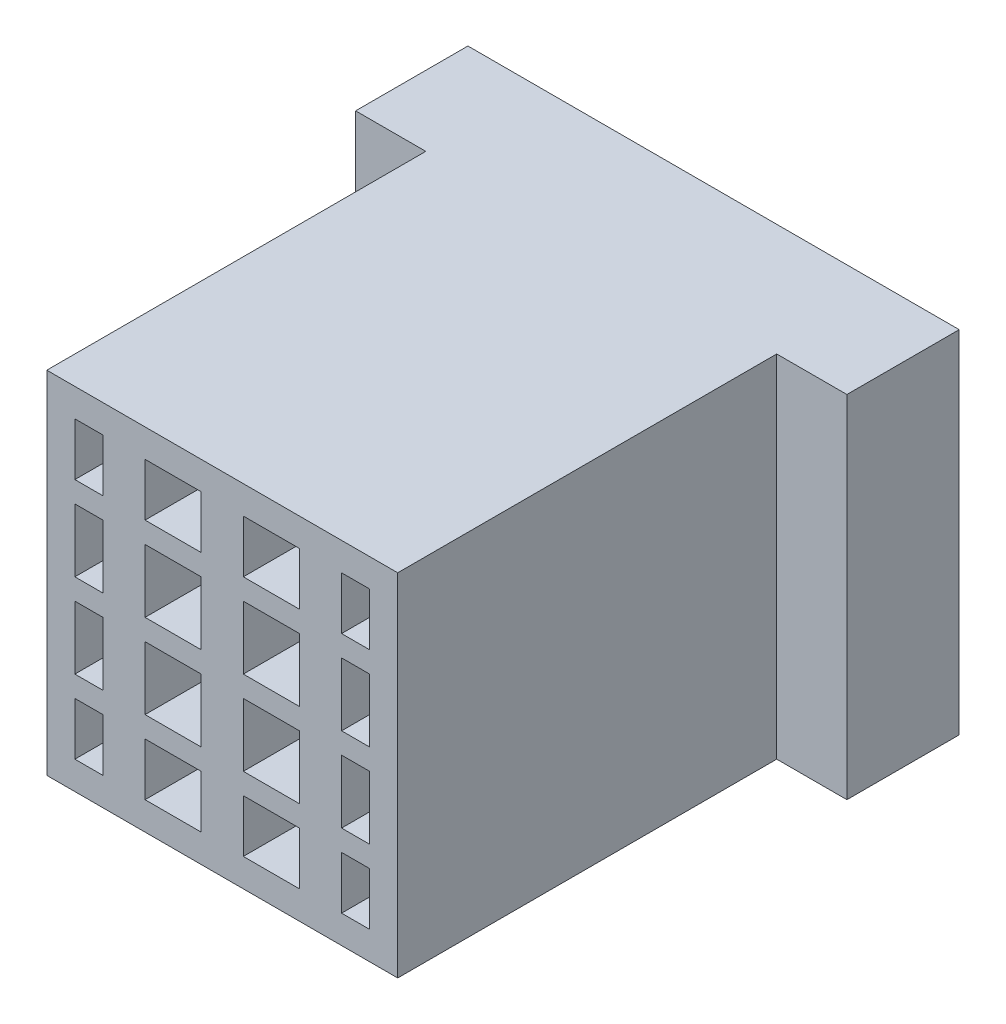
ISO-10303-21;
HEADER;
FILE_DESCRIPTION(('STEP AP214'),'2;1');
FILE_NAME('part.step','',(''),(''),'','','');
FILE_SCHEMA(('AUTOMOTIVE_DESIGN { 1 0 10303 214 1 1 1 1 }'));
ENDSEC;
DATA;
#1=APPLICATION_CONTEXT('core data for automotive mechanical design processes');
#2=APPLICATION_PROTOCOL_DEFINITION('international standard','automotive_design',2000,#1);
#3=PRODUCT_CONTEXT('',#1,'mechanical');
#4=PRODUCT('Part','Part','',(#3));
#5=PRODUCT_RELATED_PRODUCT_CATEGORY('part','',(#4));
#6=PRODUCT_DEFINITION_FORMATION('','',#4);
#7=PRODUCT_DEFINITION_CONTEXT('part definition',#1,'design');
#8=PRODUCT_DEFINITION('design','',#6,#7);
#9=PRODUCT_DEFINITION_SHAPE('','',#8);
#10=(LENGTH_UNIT() NAMED_UNIT(*) SI_UNIT(.MILLI.,.METRE.));
#11=(NAMED_UNIT(*) PLANE_ANGLE_UNIT() SI_UNIT($,.RADIAN.));
#12=(NAMED_UNIT(*) SI_UNIT($,.STERADIAN.) SOLID_ANGLE_UNIT());
#13=UNCERTAINTY_MEASURE_WITH_UNIT(LENGTH_MEASURE(1.E-05),#10,'distance_accuracy_value','');
#14=(GEOMETRIC_REPRESENTATION_CONTEXT(3) GLOBAL_UNCERTAINTY_ASSIGNED_CONTEXT((#13)) GLOBAL_UNIT_ASSIGNED_CONTEXT((#10,
#11,#12)) REPRESENTATION_CONTEXT('',''));
#15=CARTESIAN_POINT('',(0.,0.,0.));
#16=DIRECTION('',(0.,0.,1.));
#17=DIRECTION('',(1.,0.,0.));
#18=AXIS2_PLACEMENT_3D('',#15,#16,#17);
#19=CARTESIAN_POINT('',(-1.5,-10.5,25.));
#20=DIRECTION('',(-1.,0.,0.));
#21=DIRECTION('',(0.,0.,1.));
#22=AXIS2_PLACEMENT_3D('',#19,#20,#21);
#23=PLANE('',#22);
#24=DIRECTION('',(0.,0.,-1.));
#25=VECTOR('',#24,1.);
#26=CARTESIAN_POINT('',(-1.5,6.75,25.));
#27=LINE('',#26,#25);
#28=CARTESIAN_POINT('',(-1.5,6.75,25.));
#29=VERTEX_POINT('',#28);
#30=CARTESIAN_POINT('',(-1.5,6.75,0.));
#31=VERTEX_POINT('',#30);
#32=EDGE_CURVE('E607',#29,#31,#27,.T.);
#33=ORIENTED_EDGE('',*,*,#32,.F.);
#34=DIRECTION('',(0.,1.,0.));
#35=VECTOR('',#34,1.);
#36=CARTESIAN_POINT('',(-1.5,-10.5,25.));
#37=LINE('',#36,#35);
#38=CARTESIAN_POINT('',(-1.5,10.5,25.));
#39=VERTEX_POINT('',#38);
#40=EDGE_CURVE('E936',#29,#39,#37,.T.);
#41=ORIENTED_EDGE('',*,*,#40,.T.);
#42=DIRECTION('',(0.,0.,-1.));
#43=VECTOR('',#42,1.);
#44=CARTESIAN_POINT('',(-1.5,10.5,25.));
#45=LINE('',#44,#43);
#46=CARTESIAN_POINT('',(-1.5,10.5,0.));
#47=VERTEX_POINT('',#46);
#48=EDGE_CURVE('E971',#39,#47,#45,.T.);
#49=ORIENTED_EDGE('',*,*,#48,.T.);
#50=DIRECTION('',(0.,1.,0.));
#51=VECTOR('',#50,1.);
#52=CARTESIAN_POINT('',(-1.5,-10.5,0.));
#53=LINE('',#52,#51);
#54=EDGE_CURVE('E931',#31,#47,#53,.T.);
#55=ORIENTED_EDGE('',*,*,#54,.F.);
#56=EDGE_LOOP('',(#33,#41,#49,#55));
#57=FACE_BOUND('',#56,.T.);
#58=ADVANCED_FACE('F40',(#57),#23,.T.);
#59=CARTESIAN_POINT('',(-5.5,-10.5,25.));
#60=DIRECTION('',(1.,0.,0.));
#61=DIRECTION('',(0.,0.,-1.));
#62=AXIS2_PLACEMENT_3D('',#59,#60,#61);
#63=PLANE('',#62);
#64=DIRECTION('',(0.,0.,1.));
#65=VECTOR('',#64,1.);
#66=CARTESIAN_POINT('',(-5.5,6.75,25.));
#67=LINE('',#66,#65);
#68=CARTESIAN_POINT('',(-5.5,6.75,0.));
#69=VERTEX_POINT('',#68);
#70=CARTESIAN_POINT('',(-5.5,6.75,25.));
#71=VERTEX_POINT('',#70);
#72=EDGE_CURVE('E604',#69,#71,#67,.T.);
#73=ORIENTED_EDGE('',*,*,#72,.F.);
#74=DIRECTION('',(0.,-1.,0.));
#75=VECTOR('',#74,1.);
#76=CARTESIAN_POINT('',(-5.5,-10.5,0.));
#77=LINE('',#76,#75);
#78=CARTESIAN_POINT('',(-5.5,10.5,0.));
#79=VERTEX_POINT('',#78);
#80=EDGE_CURVE('E956',#79,#69,#77,.T.);
#81=ORIENTED_EDGE('',*,*,#80,.F.);
#82=DIRECTION('',(0.,0.,-1.));
#83=VECTOR('',#82,1.);
#84=CARTESIAN_POINT('',(-5.5,10.5,25.));
#85=LINE('',#84,#83);
#86=CARTESIAN_POINT('',(-5.5,10.5,25.));
#87=VERTEX_POINT('',#86);
#88=EDGE_CURVE('E969',#87,#79,#85,.T.);
#89=ORIENTED_EDGE('',*,*,#88,.F.);
#90=DIRECTION('',(0.,-1.,0.));
#91=VECTOR('',#90,1.);
#92=CARTESIAN_POINT('',(-5.5,-10.5,25.));
#93=LINE('',#92,#91);
#94=EDGE_CURVE('E940',#87,#71,#93,.T.);
#95=ORIENTED_EDGE('',*,*,#94,.T.);
#96=EDGE_LOOP('',(#73,#81,#89,#95));
#97=FACE_BOUND('',#96,.T.);
#98=ADVANCED_FACE('F1170',(#97),#63,.T.);
#99=CARTESIAN_POINT('',(-8.5,-10.5,25.));
#100=DIRECTION('',(-1.,0.,0.));
#101=DIRECTION('',(0.,0.,1.));
#102=AXIS2_PLACEMENT_3D('',#99,#100,#101);
#103=PLANE('',#102);
#104=DIRECTION('',(0.,0.,-1.));
#105=VECTOR('',#104,1.);
#106=CARTESIAN_POINT('',(-8.5,6.75,25.));
#107=LINE('',#106,#105);
#108=CARTESIAN_POINT('',(-8.5,6.74999999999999,25.));
#109=VERTEX_POINT('',#108);
#110=CARTESIAN_POINT('',(-8.5,6.74999999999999,0.));
#111=VERTEX_POINT('',#110);
#112=EDGE_CURVE('E601',#109,#111,#107,.T.);
#113=ORIENTED_EDGE('',*,*,#112,.F.);
#114=DIRECTION('',(0.,1.,0.));
#115=VECTOR('',#114,1.);
#116=CARTESIAN_POINT('',(-8.5,-10.5,25.));
#117=LINE('',#116,#115);
#118=CARTESIAN_POINT('',(-8.5,10.5,25.));
#119=VERTEX_POINT('',#118);
#120=EDGE_CURVE('E893',#109,#119,#117,.T.);
#121=ORIENTED_EDGE('',*,*,#120,.T.);
#122=DIRECTION('',(0.,0.,-1.));
#123=VECTOR('',#122,1.);
#124=CARTESIAN_POINT('',(-8.5,10.5,25.));
#125=LINE('',#124,#123);
#126=CARTESIAN_POINT('',(-8.5,10.5,0.));
#127=VERTEX_POINT('',#126);
#128=EDGE_CURVE('E928',#119,#127,#125,.T.);
#129=ORIENTED_EDGE('',*,*,#128,.T.);
#130=DIRECTION('',(0.,1.,0.));
#131=VECTOR('',#130,1.);
#132=CARTESIAN_POINT('',(-8.5,-10.5,0.));
#133=LINE('',#132,#131);
#134=EDGE_CURVE('E888',#111,#127,#133,.T.);
#135=ORIENTED_EDGE('',*,*,#134,.F.);
#136=EDGE_LOOP('',(#113,#121,#129,#135));
#137=FACE_BOUND('',#136,.T.);
#138=ADVANCED_FACE('F1176',(#137),#103,.T.);
#139=CARTESIAN_POINT('',(-10.5,-10.5,25.));
#140=DIRECTION('',(1.,0.,0.));
#141=DIRECTION('',(0.,0.,-1.));
#142=AXIS2_PLACEMENT_3D('',#139,#140,#141);
#143=PLANE('',#142);
#144=DIRECTION('',(0.,0.,1.));
#145=VECTOR('',#144,1.);
#146=CARTESIAN_POINT('',(-10.5,6.75,25.));
#147=LINE('',#146,#145);
#148=CARTESIAN_POINT('',(-10.5,6.75,0.));
#149=VERTEX_POINT('',#148);
#150=CARTESIAN_POINT('',(-10.5,6.75,25.));
#151=VERTEX_POINT('',#150);
#152=EDGE_CURVE('E598',#149,#151,#147,.T.);
#153=ORIENTED_EDGE('',*,*,#152,.F.);
#154=DIRECTION('',(0.,-1.,0.));
#155=VECTOR('',#154,1.);
#156=CARTESIAN_POINT('',(-10.5,-10.5,0.));
#157=LINE('',#156,#155);
#158=CARTESIAN_POINT('',(-10.5,10.5,0.));
#159=VERTEX_POINT('',#158);
#160=EDGE_CURVE('E913',#159,#149,#157,.T.);
#161=ORIENTED_EDGE('',*,*,#160,.F.);
#162=DIRECTION('',(0.,0.,-1.));
#163=VECTOR('',#162,1.);
#164=CARTESIAN_POINT('',(-10.5,10.5,25.));
#165=LINE('',#164,#163);
#166=CARTESIAN_POINT('',(-10.5,10.5,25.));
#167=VERTEX_POINT('',#166);
#168=EDGE_CURVE('E926',#167,#159,#165,.T.);
#169=ORIENTED_EDGE('',*,*,#168,.F.);
#170=DIRECTION('',(0.,-1.,0.));
#171=VECTOR('',#170,1.);
#172=CARTESIAN_POINT('',(-10.5,-10.5,25.));
#173=LINE('',#172,#171);
#174=EDGE_CURVE('E897',#167,#151,#173,.T.);
#175=ORIENTED_EDGE('',*,*,#174,.T.);
#176=EDGE_LOOP('',(#153,#161,#169,#175));
#177=FACE_BOUND('',#176,.T.);
#178=ADVANCED_FACE('F1270',(#177),#143,.T.);
#179=CARTESIAN_POINT('',(5.5,-10.5,25.));
#180=DIRECTION('',(-1.,0.,0.));
#181=DIRECTION('',(0.,-1.,0.));
#182=AXIS2_PLACEMENT_3D('',#179,#180,#181);
#183=PLANE('',#182);
#184=DIRECTION('',(0.,0.,-1.));
#185=VECTOR('',#184,1.);
#186=CARTESIAN_POINT('',(5.5,6.75,25.));
#187=LINE('',#186,#185);
#188=CARTESIAN_POINT('',(5.5,6.75,25.));
#189=VERTEX_POINT('',#188);
#190=CARTESIAN_POINT('',(5.5,6.75,0.));
#191=VERTEX_POINT('',#190);
#192=EDGE_CURVE('E595',#189,#191,#187,.T.);
#193=ORIENTED_EDGE('',*,*,#192,.F.);
#194=DIRECTION('',(0.,1.,0.));
#195=VECTOR('',#194,1.);
#196=CARTESIAN_POINT('',(5.5,-10.5,25.));
#197=LINE('',#196,#195);
#198=CARTESIAN_POINT('',(5.5,10.5,25.));
#199=VERTEX_POINT('',#198);
#200=EDGE_CURVE('E850',#189,#199,#197,.T.);
#201=ORIENTED_EDGE('',*,*,#200,.T.);
#202=DIRECTION('',(0.,0.,-1.));
#203=VECTOR('',#202,1.);
#204=CARTESIAN_POINT('',(5.5,10.5,25.));
#205=LINE('',#204,#203);
#206=CARTESIAN_POINT('',(5.5,10.5,0.));
#207=VERTEX_POINT('',#206);
#208=EDGE_CURVE('E885',#199,#207,#205,.T.);
#209=ORIENTED_EDGE('',*,*,#208,.T.);
#210=DIRECTION('',(0.,1.,0.));
#211=VECTOR('',#210,1.);
#212=CARTESIAN_POINT('',(5.5,-10.5,0.));
#213=LINE('',#212,#211);
#214=EDGE_CURVE('E845',#191,#207,#213,.T.);
#215=ORIENTED_EDGE('',*,*,#214,.F.);
#216=EDGE_LOOP('',(#193,#201,#209,#215));
#217=FACE_BOUND('',#216,.T.);
#218=ADVANCED_FACE('F1052',(#217),#183,.T.);
#219=CARTESIAN_POINT('',(1.5,-10.5,25.));
#220=DIRECTION('',(1.,0.,0.));
#221=DIRECTION('',(0.,1.,0.));
#222=AXIS2_PLACEMENT_3D('',#219,#220,#221);
#223=PLANE('',#222);
#224=DIRECTION('',(0.,0.,1.));
#225=VECTOR('',#224,1.);
#226=CARTESIAN_POINT('',(1.5,6.75,25.));
#227=LINE('',#226,#225);
#228=CARTESIAN_POINT('',(1.5,6.75,0.));
#229=VERTEX_POINT('',#228);
#230=CARTESIAN_POINT('',(1.5,6.75,25.));
#231=VERTEX_POINT('',#230);
#232=EDGE_CURVE('E592',#229,#231,#227,.T.);
#233=ORIENTED_EDGE('',*,*,#232,.F.);
#234=DIRECTION('',(0.,-1.,0.));
#235=VECTOR('',#234,1.);
#236=CARTESIAN_POINT('',(1.5,-10.5,0.));
#237=LINE('',#236,#235);
#238=CARTESIAN_POINT('',(1.5,10.5,0.));
#239=VERTEX_POINT('',#238);
#240=EDGE_CURVE('E870',#239,#229,#237,.T.);
#241=ORIENTED_EDGE('',*,*,#240,.F.);
#242=DIRECTION('',(0.,0.,-1.));
#243=VECTOR('',#242,1.);
#244=CARTESIAN_POINT('',(1.5,10.5,25.));
#245=LINE('',#244,#243);
#246=CARTESIAN_POINT('',(1.5,10.5,25.));
#247=VERTEX_POINT('',#246);
#248=EDGE_CURVE('E883',#247,#239,#245,.T.);
#249=ORIENTED_EDGE('',*,*,#248,.F.);
#250=DIRECTION('',(0.,-1.,0.));
#251=VECTOR('',#250,1.);
#252=CARTESIAN_POINT('',(1.5,-10.5,25.));
#253=LINE('',#252,#251);
#254=EDGE_CURVE('E854',#247,#231,#253,.T.);
#255=ORIENTED_EDGE('',*,*,#254,.T.);
#256=EDGE_LOOP('',(#233,#241,#249,#255));
#257=FACE_BOUND('',#256,.T.);
#258=ADVANCED_FACE('F1066',(#257),#223,.T.);
#259=CARTESIAN_POINT('',(10.5,-10.5,25.));
#260=DIRECTION('',(-1.,0.,0.));
#261=DIRECTION('',(0.,-1.,0.));
#262=AXIS2_PLACEMENT_3D('',#259,#260,#261);
#263=PLANE('',#262);
#264=DIRECTION('',(0.,0.,-1.));
#265=VECTOR('',#264,1.);
#266=CARTESIAN_POINT('',(10.5,6.75,25.));
#267=LINE('',#266,#265);
#268=CARTESIAN_POINT('',(10.5,6.75,25.));
#269=VERTEX_POINT('',#268);
#270=CARTESIAN_POINT('',(10.5,6.75,0.));
#271=VERTEX_POINT('',#270);
#272=EDGE_CURVE('E589',#269,#271,#267,.T.);
#273=ORIENTED_EDGE('',*,*,#272,.F.);
#274=DIRECTION('',(0.,1.,0.));
#275=VECTOR('',#274,1.);
#276=CARTESIAN_POINT('',(10.5,-10.5,25.));
#277=LINE('',#276,#275);
#278=CARTESIAN_POINT('',(10.5,10.5,25.));
#279=VERTEX_POINT('',#278);
#280=EDGE_CURVE('E808',#269,#279,#277,.T.);
#281=ORIENTED_EDGE('',*,*,#280,.T.);
#282=DIRECTION('',(0.,0.,-1.));
#283=VECTOR('',#282,1.);
#284=CARTESIAN_POINT('',(10.5,10.5,25.));
#285=LINE('',#284,#283);
#286=CARTESIAN_POINT('',(10.5,10.5,0.));
#287=VERTEX_POINT('',#286);
#288=EDGE_CURVE('E842',#279,#287,#285,.T.);
#289=ORIENTED_EDGE('',*,*,#288,.T.);
#290=DIRECTION('',(0.,1.,0.));
#291=VECTOR('',#290,1.);
#292=CARTESIAN_POINT('',(10.5,-10.5,0.));
#293=LINE('',#292,#291);
#294=EDGE_CURVE('E803',#271,#287,#293,.T.);
#295=ORIENTED_EDGE('',*,*,#294,.F.);
#296=EDGE_LOOP('',(#273,#281,#289,#295));
#297=FACE_BOUND('',#296,.T.);
#298=ADVANCED_FACE('F1090',(#297),#263,.T.);
#299=CARTESIAN_POINT('',(8.5,-10.5,25.));
#300=DIRECTION('',(1.,0.,0.));
#301=DIRECTION('',(0.,1.,0.));
#302=AXIS2_PLACEMENT_3D('',#299,#300,#301);
#303=PLANE('',#302);
#304=DIRECTION('',(0.,0.,1.));
#305=VECTOR('',#304,1.);
#306=CARTESIAN_POINT('',(8.5,6.75,25.));
#307=LINE('',#306,#305);
#308=CARTESIAN_POINT('',(8.5,6.74999999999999,0.));
#309=VERTEX_POINT('',#308);
#310=CARTESIAN_POINT('',(8.5,6.74999999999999,25.));
#311=VERTEX_POINT('',#310);
#312=EDGE_CURVE('E64',#309,#311,#307,.T.);
#313=ORIENTED_EDGE('',*,*,#312,.F.);
#314=DIRECTION('',(0.,-1.,0.));
#315=VECTOR('',#314,1.);
#316=CARTESIAN_POINT('',(8.5,-10.5,0.));
#317=LINE('',#316,#315);
#318=CARTESIAN_POINT('',(8.5,10.5,0.));
#319=VERTEX_POINT('',#318);
#320=EDGE_CURVE('E828',#319,#309,#317,.T.);
#321=ORIENTED_EDGE('',*,*,#320,.F.);
#322=DIRECTION('',(0.,0.,-1.));
#323=VECTOR('',#322,1.);
#324=CARTESIAN_POINT('',(8.5,10.5,25.));
#325=LINE('',#324,#323);
#326=CARTESIAN_POINT('',(8.5,10.5,25.));
#327=VERTEX_POINT('',#326);
#328=EDGE_CURVE('E840',#327,#319,#325,.T.);
#329=ORIENTED_EDGE('',*,*,#328,.F.);
#330=DIRECTION('',(0.,-1.,0.));
#331=VECTOR('',#330,1.);
#332=CARTESIAN_POINT('',(8.5,-10.5,25.));
#333=LINE('',#332,#331);
#334=EDGE_CURVE('E812',#327,#311,#333,.T.);
#335=ORIENTED_EDGE('',*,*,#334,.T.);
#336=EDGE_LOOP('',(#313,#321,#329,#335));
#337=FACE_BOUND('',#336,.T.);
#338=ADVANCED_FACE('F1166',(#337),#303,.T.);
#339=CARTESIAN_POINT('',(0.,0.,0.));
#340=DIRECTION('',(0.,0.,1.));
#341=DIRECTION('',(1.,0.,0.));
#342=AXIS2_PLACEMENT_3D('',#339,#340,#341);
#343=PLANE('',#342);
#344=DIRECTION('',(-1.,0.,0.));
#345=VECTOR('',#344,1.);
#346=CARTESIAN_POINT('',(12.5,6.75,0.));
#347=LINE('',#346,#345);
#348=EDGE_CURVE('E555',#271,#309,#347,.T.);
#349=ORIENTED_EDGE('',*,*,#348,.F.);
#350=ORIENTED_EDGE('',*,*,#294,.T.);
#351=DIRECTION('',(-1.,0.,0.));
#352=VECTOR('',#351,1.);
#353=CARTESIAN_POINT('',(10.5,10.5,0.));
#354=LINE('',#353,#352);
#355=EDGE_CURVE('E822',#287,#319,#354,.T.);
#356=ORIENTED_EDGE('',*,*,#355,.T.);
#357=ORIENTED_EDGE('',*,*,#320,.T.);
#358=EDGE_LOOP('',(#349,#350,#356,#357));
#359=FACE_BOUND('',#358,.T.);
#360=ADVANCED_FACE('F1087',(#359),#343,.T.);
#361=EDGE_CURVE('E1071',#191,#229,#347,.T.);
#362=ORIENTED_EDGE('',*,*,#361,.F.);
#363=ORIENTED_EDGE('',*,*,#214,.T.);
#364=DIRECTION('',(-1.,0.,0.));
#365=VECTOR('',#364,1.);
#366=CARTESIAN_POINT('',(5.5,10.5,0.));
#367=LINE('',#366,#365);
#368=EDGE_CURVE('E864',#207,#239,#367,.T.);
#369=ORIENTED_EDGE('',*,*,#368,.T.);
#370=ORIENTED_EDGE('',*,*,#240,.T.);
#371=EDGE_LOOP('',(#362,#363,#369,#370));
#372=FACE_BOUND('',#371,.T.);
#373=ADVANCED_FACE('F1157',(#372),#343,.T.);
#374=EDGE_CURVE('E551',#111,#149,#347,.T.);
#375=ORIENTED_EDGE('',*,*,#374,.F.);
#376=ORIENTED_EDGE('',*,*,#134,.T.);
#377=DIRECTION('',(-1.,0.,0.));
#378=VECTOR('',#377,1.);
#379=CARTESIAN_POINT('',(-10.5,10.5,0.));
#380=LINE('',#379,#378);
#381=EDGE_CURVE('E907',#127,#159,#380,.T.);
#382=ORIENTED_EDGE('',*,*,#381,.T.);
#383=ORIENTED_EDGE('',*,*,#160,.T.);
#384=EDGE_LOOP('',(#375,#376,#382,#383));
#385=FACE_BOUND('',#384,.T.);
#386=ADVANCED_FACE('F1159',(#385),#343,.T.);
#387=EDGE_CURVE('E554',#31,#69,#347,.T.);
#388=ORIENTED_EDGE('',*,*,#387,.F.);
#389=ORIENTED_EDGE('',*,*,#54,.T.);
#390=DIRECTION('',(-1.,0.,0.));
#391=VECTOR('',#390,1.);
#392=CARTESIAN_POINT('',(-5.5,10.5,0.));
#393=LINE('',#392,#391);
#394=EDGE_CURVE('E950',#47,#79,#393,.T.);
#395=ORIENTED_EDGE('',*,*,#394,.T.);
#396=ORIENTED_EDGE('',*,*,#80,.T.);
#397=EDGE_LOOP('',(#388,#389,#395,#396));
#398=FACE_BOUND('',#397,.T.);
#399=ADVANCED_FACE('F1012',(#398),#343,.T.);
#400=DIRECTION('',(0.,0.,1.));
#401=VECTOR('',#400,1.);
#402=CARTESIAN_POINT('',(-1.5,-6.75,25.));
#403=LINE('',#402,#401);
#404=CARTESIAN_POINT('',(-1.5,-6.75,0.));
#405=VERTEX_POINT('',#404);
#406=CARTESIAN_POINT('',(-1.5,-6.75,25.));
#407=VERTEX_POINT('',#406);
#408=EDGE_CURVE('E675',#405,#407,#403,.T.);
#409=ORIENTED_EDGE('',*,*,#408,.F.);
#410=CARTESIAN_POINT('',(-1.5,-10.5,0.));
#411=VERTEX_POINT('',#410);
#412=EDGE_CURVE('E947',#411,#405,#53,.T.);
#413=ORIENTED_EDGE('',*,*,#412,.F.);
#414=DIRECTION('',(0.,0.,-1.));
#415=VECTOR('',#414,1.);
#416=CARTESIAN_POINT('',(-1.5,-10.5,25.));
#417=LINE('',#416,#415);
#418=CARTESIAN_POINT('',(-1.5,-10.5,25.));
#419=VERTEX_POINT('',#418);
#420=EDGE_CURVE('E946',#419,#411,#417,.T.);
#421=ORIENTED_EDGE('',*,*,#420,.F.);
#422=EDGE_CURVE('E932',#419,#407,#37,.T.);
#423=ORIENTED_EDGE('',*,*,#422,.T.);
#424=EDGE_LOOP('',(#409,#413,#421,#423));
#425=FACE_BOUND('',#424,.T.);
#426=ADVANCED_FACE('F1172',(#425),#23,.T.);
#427=DIRECTION('',(0.,0.,-1.));
#428=VECTOR('',#427,1.);
#429=CARTESIAN_POINT('',(-5.5,-6.75,25.));
#430=LINE('',#429,#428);
#431=CARTESIAN_POINT('',(-5.5,-6.75,25.));
#432=VERTEX_POINT('',#431);
#433=CARTESIAN_POINT('',(-5.5,-6.75,0.));
#434=VERTEX_POINT('',#433);
#435=EDGE_CURVE('E672',#432,#434,#430,.T.);
#436=ORIENTED_EDGE('',*,*,#435,.F.);
#437=CARTESIAN_POINT('',(-5.5,-10.5,25.));
#438=VERTEX_POINT('',#437);
#439=EDGE_CURVE('E939',#432,#438,#93,.T.);
#440=ORIENTED_EDGE('',*,*,#439,.T.);
#441=DIRECTION('',(0.,0.,-1.));
#442=VECTOR('',#441,1.);
#443=CARTESIAN_POINT('',(-5.5,-10.5,25.));
#444=LINE('',#443,#442);
#445=CARTESIAN_POINT('',(-5.5,-10.5,0.));
#446=VERTEX_POINT('',#445);
#447=EDGE_CURVE('E966',#438,#446,#444,.T.);
#448=ORIENTED_EDGE('',*,*,#447,.T.);
#449=EDGE_CURVE('E955',#434,#446,#77,.T.);
#450=ORIENTED_EDGE('',*,*,#449,.F.);
#451=EDGE_LOOP('',(#436,#440,#448,#450));
#452=FACE_BOUND('',#451,.T.);
#453=ADVANCED_FACE('F1179',(#452),#63,.T.);
#454=DIRECTION('',(0.,0.,1.));
#455=VECTOR('',#454,1.);
#456=CARTESIAN_POINT('',(-8.5,-6.75,25.));
#457=LINE('',#456,#455);
#458=CARTESIAN_POINT('',(-8.5,-6.75,0.));
#459=VERTEX_POINT('',#458);
#460=CARTESIAN_POINT('',(-8.5,-6.75,25.));
#461=VERTEX_POINT('',#460);
#462=EDGE_CURVE('E669',#459,#461,#457,.T.);
#463=ORIENTED_EDGE('',*,*,#462,.F.);
#464=CARTESIAN_POINT('',(-8.5,-10.5,0.));
#465=VERTEX_POINT('',#464);
#466=EDGE_CURVE('E904',#465,#459,#133,.T.);
#467=ORIENTED_EDGE('',*,*,#466,.F.);
#468=DIRECTION('',(0.,0.,-1.));
#469=VECTOR('',#468,1.);
#470=CARTESIAN_POINT('',(-8.5,-10.5,25.));
#471=LINE('',#470,#469);
#472=CARTESIAN_POINT('',(-8.5,-10.5,25.));
#473=VERTEX_POINT('',#472);
#474=EDGE_CURVE('E903',#473,#465,#471,.T.);
#475=ORIENTED_EDGE('',*,*,#474,.F.);
#476=EDGE_CURVE('E889',#473,#461,#117,.T.);
#477=ORIENTED_EDGE('',*,*,#476,.T.);
#478=EDGE_LOOP('',(#463,#467,#475,#477));
#479=FACE_BOUND('',#478,.T.);
#480=ADVANCED_FACE('F1307',(#479),#103,.T.);
#481=DIRECTION('',(0.,0.,-1.));
#482=VECTOR('',#481,1.);
#483=CARTESIAN_POINT('',(-10.5,-6.75,25.));
#484=LINE('',#483,#482);
#485=CARTESIAN_POINT('',(-10.5,-6.75,25.));
#486=VERTEX_POINT('',#485);
#487=CARTESIAN_POINT('',(-10.5,-6.75,0.));
#488=VERTEX_POINT('',#487);
#489=EDGE_CURVE('E666',#486,#488,#484,.T.);
#490=ORIENTED_EDGE('',*,*,#489,.F.);
#491=CARTESIAN_POINT('',(-10.5,-10.5,25.));
#492=VERTEX_POINT('',#491);
#493=EDGE_CURVE('E896',#486,#492,#173,.T.);
#494=ORIENTED_EDGE('',*,*,#493,.T.);
#495=DIRECTION('',(0.,0.,-1.));
#496=VECTOR('',#495,1.);
#497=CARTESIAN_POINT('',(-10.5,-10.5,25.));
#498=LINE('',#497,#496);
#499=CARTESIAN_POINT('',(-10.5,-10.5,0.));
#500=VERTEX_POINT('',#499);
#501=EDGE_CURVE('E923',#492,#500,#498,.T.);
#502=ORIENTED_EDGE('',*,*,#501,.T.);
#503=EDGE_CURVE('E912',#488,#500,#157,.T.);
#504=ORIENTED_EDGE('',*,*,#503,.F.);
#505=EDGE_LOOP('',(#490,#494,#502,#504));
#506=FACE_BOUND('',#505,.T.);
#507=ADVANCED_FACE('F1295',(#506),#143,.T.);
#508=DIRECTION('',(0.,0.,1.));
#509=VECTOR('',#508,1.);
#510=CARTESIAN_POINT('',(5.5,-6.75,25.));
#511=LINE('',#510,#509);
#512=CARTESIAN_POINT('',(5.5,-6.75,0.));
#513=VERTEX_POINT('',#512);
#514=CARTESIAN_POINT('',(5.5,-6.75,25.));
#515=VERTEX_POINT('',#514);
#516=EDGE_CURVE('E663',#513,#515,#511,.T.);
#517=ORIENTED_EDGE('',*,*,#516,.F.);
#518=CARTESIAN_POINT('',(5.5,-10.5,0.));
#519=VERTEX_POINT('',#518);
#520=EDGE_CURVE('E861',#519,#513,#213,.T.);
#521=ORIENTED_EDGE('',*,*,#520,.F.);
#522=DIRECTION('',(0.,0.,-1.));
#523=VECTOR('',#522,1.);
#524=CARTESIAN_POINT('',(5.5,-10.5,25.));
#525=LINE('',#524,#523);
#526=CARTESIAN_POINT('',(5.5,-10.5,25.));
#527=VERTEX_POINT('',#526);
#528=EDGE_CURVE('E860',#527,#519,#525,.T.);
#529=ORIENTED_EDGE('',*,*,#528,.F.);
#530=EDGE_CURVE('E846',#527,#515,#197,.T.);
#531=ORIENTED_EDGE('',*,*,#530,.T.);
#532=EDGE_LOOP('',(#517,#521,#529,#531));
#533=FACE_BOUND('',#532,.T.);
#534=ADVANCED_FACE('F1373',(#533),#183,.T.);
#535=DIRECTION('',(0.,0.,-1.));
#536=VECTOR('',#535,1.);
#537=CARTESIAN_POINT('',(1.5,-6.75,25.));
#538=LINE('',#537,#536);
#539=CARTESIAN_POINT('',(1.5,-6.75,25.));
#540=VERTEX_POINT('',#539);
#541=CARTESIAN_POINT('',(1.5,-6.75,0.));
#542=VERTEX_POINT('',#541);
#543=EDGE_CURVE('E660',#540,#542,#538,.T.);
#544=ORIENTED_EDGE('',*,*,#543,.F.);
#545=CARTESIAN_POINT('',(1.5,-10.5,25.));
#546=VERTEX_POINT('',#545);
#547=EDGE_CURVE('E853',#540,#546,#253,.T.);
#548=ORIENTED_EDGE('',*,*,#547,.T.);
#549=DIRECTION('',(0.,0.,-1.));
#550=VECTOR('',#549,1.);
#551=CARTESIAN_POINT('',(1.5,-10.5,25.));
#552=LINE('',#551,#550);
#553=CARTESIAN_POINT('',(1.5,-10.5,0.));
#554=VERTEX_POINT('',#553);
#555=EDGE_CURVE('E880',#546,#554,#552,.T.);
#556=ORIENTED_EDGE('',*,*,#555,.T.);
#557=EDGE_CURVE('E869',#542,#554,#237,.T.);
#558=ORIENTED_EDGE('',*,*,#557,.F.);
#559=EDGE_LOOP('',(#544,#548,#556,#558));
#560=FACE_BOUND('',#559,.T.);
#561=ADVANCED_FACE('F1237',(#560),#223,.T.);
#562=DIRECTION('',(0.,0.,1.));
#563=VECTOR('',#562,1.);
#564=CARTESIAN_POINT('',(10.5,-6.75,25.));
#565=LINE('',#564,#563);
#566=CARTESIAN_POINT('',(10.5,-6.75,0.));
#567=VERTEX_POINT('',#566);
#568=CARTESIAN_POINT('',(10.5,-6.75,25.));
#569=VERTEX_POINT('',#568);
#570=EDGE_CURVE('E657',#567,#569,#565,.T.);
#571=ORIENTED_EDGE('',*,*,#570,.F.);
#572=CARTESIAN_POINT('',(10.5,-10.5,0.));
#573=VERTEX_POINT('',#572);
#574=EDGE_CURVE('E819',#573,#567,#293,.T.);
#575=ORIENTED_EDGE('',*,*,#574,.F.);
#576=DIRECTION('',(0.,0.,-1.));
#577=VECTOR('',#576,1.);
#578=CARTESIAN_POINT('',(10.5,-10.5,25.));
#579=LINE('',#578,#577);
#580=CARTESIAN_POINT('',(10.5,-10.5,25.));
#581=VERTEX_POINT('',#580);
#582=EDGE_CURVE('E818',#581,#573,#579,.T.);
#583=ORIENTED_EDGE('',*,*,#582,.F.);
#584=EDGE_CURVE('E804',#581,#569,#277,.T.);
#585=ORIENTED_EDGE('',*,*,#584,.T.);
#586=EDGE_LOOP('',(#571,#575,#583,#585));
#587=FACE_BOUND('',#586,.T.);
#588=ADVANCED_FACE('F1126',(#587),#263,.T.);
#589=DIRECTION('',(0.,0.,-1.));
#590=VECTOR('',#589,1.);
#591=CARTESIAN_POINT('',(8.5,-6.75,25.));
#592=LINE('',#591,#590);
#593=CARTESIAN_POINT('',(8.5,-6.75,25.));
#594=VERTEX_POINT('',#593);
#595=CARTESIAN_POINT('',(8.5,-6.75,0.));
#596=VERTEX_POINT('',#595);
#597=EDGE_CURVE('E654',#594,#596,#592,.T.);
#598=ORIENTED_EDGE('',*,*,#597,.F.);
#599=CARTESIAN_POINT('',(8.5,-10.5,25.));
#600=VERTEX_POINT('',#599);
#601=EDGE_CURVE('E811',#594,#600,#333,.T.);
#602=ORIENTED_EDGE('',*,*,#601,.T.);
#603=DIRECTION('',(0.,0.,-1.));
#604=VECTOR('',#603,1.);
#605=CARTESIAN_POINT('',(8.5,-10.5,25.));
#606=LINE('',#605,#604);
#607=CARTESIAN_POINT('',(8.5,-10.5,0.));
#608=VERTEX_POINT('',#607);
#609=EDGE_CURVE('E837',#600,#608,#606,.T.);
#610=ORIENTED_EDGE('',*,*,#609,.T.);
#611=EDGE_CURVE('E827',#596,#608,#317,.T.);
#612=ORIENTED_EDGE('',*,*,#611,.F.);
#613=EDGE_LOOP('',(#598,#602,#610,#612));
#614=FACE_BOUND('',#613,.T.);
#615=ADVANCED_FACE('F1114',(#614),#303,.T.);
#616=DIRECTION('',(1.,0.,0.));
#617=VECTOR('',#616,1.);
#618=CARTESIAN_POINT('',(12.5,-6.75,0.));
#619=LINE('',#618,#617);
#620=EDGE_CURVE('E617',#596,#567,#619,.T.);
#621=ORIENTED_EDGE('',*,*,#620,.F.);
#622=ORIENTED_EDGE('',*,*,#611,.T.);
#623=DIRECTION('',(1.,0.,0.));
#624=VECTOR('',#623,1.);
#625=CARTESIAN_POINT('',(10.5,-10.5,0.));
#626=LINE('',#625,#624);
#627=EDGE_CURVE('E830',#608,#573,#626,.T.);
#628=ORIENTED_EDGE('',*,*,#627,.T.);
#629=ORIENTED_EDGE('',*,*,#574,.T.);
#630=EDGE_LOOP('',(#621,#622,#628,#629));
#631=FACE_BOUND('',#630,.T.);
#632=ADVANCED_FACE('F1130',(#631),#343,.T.);
#633=EDGE_CURVE('E620',#542,#513,#619,.T.);
#634=ORIENTED_EDGE('',*,*,#633,.F.);
#635=ORIENTED_EDGE('',*,*,#557,.T.);
#636=DIRECTION('',(1.,0.,0.));
#637=VECTOR('',#636,1.);
#638=CARTESIAN_POINT('',(5.5,-10.5,0.));
#639=LINE('',#638,#637);
#640=EDGE_CURVE('E873',#554,#519,#639,.T.);
#641=ORIENTED_EDGE('',*,*,#640,.T.);
#642=ORIENTED_EDGE('',*,*,#520,.T.);
#643=EDGE_LOOP('',(#634,#635,#641,#642));
#644=FACE_BOUND('',#643,.T.);
#645=ADVANCED_FACE('F1229',(#644),#343,.T.);
#646=EDGE_CURVE('E621',#488,#459,#619,.T.);
#647=ORIENTED_EDGE('',*,*,#646,.F.);
#648=ORIENTED_EDGE('',*,*,#503,.T.);
#649=DIRECTION('',(1.,0.,0.));
#650=VECTOR('',#649,1.);
#651=CARTESIAN_POINT('',(-10.5,-10.5,0.));
#652=LINE('',#651,#650);
#653=EDGE_CURVE('E916',#500,#465,#652,.T.);
#654=ORIENTED_EDGE('',*,*,#653,.T.);
#655=ORIENTED_EDGE('',*,*,#466,.T.);
#656=EDGE_LOOP('',(#647,#648,#654,#655));
#657=FACE_BOUND('',#656,.T.);
#658=ADVANCED_FACE('F1205',(#657),#343,.T.);
#659=DIRECTION('',(1.,0.,0.));
#660=VECTOR('',#659,1.);
#661=CARTESIAN_POINT('',(0.,-6.75,0.));
#662=LINE('',#661,#660);
#663=EDGE_CURVE('E11',#434,#405,#662,.T.);
#664=ORIENTED_EDGE('',*,*,#663,.F.);
#665=ORIENTED_EDGE('',*,*,#449,.T.);
#666=DIRECTION('',(1.,0.,0.));
#667=VECTOR('',#666,1.);
#668=CARTESIAN_POINT('',(-5.5,-10.5,0.));
#669=LINE('',#668,#667);
#670=EDGE_CURVE('E959',#446,#411,#669,.T.);
#671=ORIENTED_EDGE('',*,*,#670,.T.);
#672=ORIENTED_EDGE('',*,*,#412,.T.);
#673=EDGE_LOOP('',(#664,#665,#671,#672));
#674=FACE_BOUND('',#673,.T.);
#675=ADVANCED_FACE('F1197',(#674),#343,.T.);
#676=DIRECTION('',(0.,0.,1.));
#677=VECTOR('',#676,1.);
#678=CARTESIAN_POINT('',(-1.5,5.25,25.));
#679=LINE('',#678,#677);
#680=CARTESIAN_POINT('',(-1.5,5.25,0.));
#681=VERTEX_POINT('',#680);
#682=CARTESIAN_POINT('',(-1.5,5.25,25.));
#683=VERTEX_POINT('',#682);
#684=EDGE_CURVE('E585',#681,#683,#679,.T.);
#685=ORIENTED_EDGE('',*,*,#684,.F.);
#686=CARTESIAN_POINT('',(-1.5,0.750000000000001,0.));
#687=VERTEX_POINT('',#686);
#688=EDGE_CURVE('E952',#687,#681,#53,.T.);
#689=ORIENTED_EDGE('',*,*,#688,.F.);
#690=DIRECTION('',(0.,0.,-1.));
#691=VECTOR('',#690,1.);
#692=CARTESIAN_POINT('',(-1.5,0.750000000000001,25.));
#693=LINE('',#692,#691);
#694=CARTESIAN_POINT('',(-1.5,0.750000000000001,25.));
#695=VERTEX_POINT('',#694);
#696=EDGE_CURVE('E743',#695,#687,#693,.T.);
#697=ORIENTED_EDGE('',*,*,#696,.F.);
#698=EDGE_CURVE('E937',#695,#683,#37,.T.);
#699=ORIENTED_EDGE('',*,*,#698,.T.);
#700=EDGE_LOOP('',(#685,#689,#697,#699));
#701=FACE_BOUND('',#700,.T.);
#702=ADVANCED_FACE('F1185',(#701),#23,.T.);
#703=DIRECTION('',(0.,0.,-1.));
#704=VECTOR('',#703,1.);
#705=CARTESIAN_POINT('',(-5.5,5.25,25.));
#706=LINE('',#705,#704);
#707=CARTESIAN_POINT('',(-5.5,5.25,25.));
#708=VERTEX_POINT('',#707);
#709=CARTESIAN_POINT('',(-5.5,5.25,0.));
#710=VERTEX_POINT('',#709);
#711=EDGE_CURVE('E582',#708,#710,#706,.T.);
#712=ORIENTED_EDGE('',*,*,#711,.F.);
#713=CARTESIAN_POINT('',(-5.5,0.750000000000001,25.));
#714=VERTEX_POINT('',#713);
#715=EDGE_CURVE('E943',#708,#714,#93,.T.);
#716=ORIENTED_EDGE('',*,*,#715,.T.);
#717=DIRECTION('',(0.,0.,1.));
#718=VECTOR('',#717,1.);
#719=CARTESIAN_POINT('',(-5.5,0.750000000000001,25.));
#720=LINE('',#719,#718);
#721=CARTESIAN_POINT('',(-5.5,0.750000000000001,0.));
#722=VERTEX_POINT('',#721);
#723=EDGE_CURVE('E740',#722,#714,#720,.T.);
#724=ORIENTED_EDGE('',*,*,#723,.F.);
#725=EDGE_CURVE('E960',#710,#722,#77,.T.);
#726=ORIENTED_EDGE('',*,*,#725,.F.);
#727=EDGE_LOOP('',(#712,#716,#724,#726));
#728=FACE_BOUND('',#727,.T.);
#729=ADVANCED_FACE('F1196',(#728),#63,.T.);
#730=DIRECTION('',(0.,0.,1.));
#731=VECTOR('',#730,1.);
#732=CARTESIAN_POINT('',(-8.5,5.25,25.));
#733=LINE('',#732,#731);
#734=CARTESIAN_POINT('',(-8.49999999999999,5.25,0.));
#735=VERTEX_POINT('',#734);
#736=CARTESIAN_POINT('',(-8.5,5.24999999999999,25.));
#737=VERTEX_POINT('',#736);
#738=EDGE_CURVE('E579',#735,#737,#733,.T.);
#739=ORIENTED_EDGE('',*,*,#738,.F.);
#740=CARTESIAN_POINT('',(-8.5,0.749999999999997,0.));
#741=VERTEX_POINT('',#740);
#742=EDGE_CURVE('E909',#741,#735,#133,.T.);
#743=ORIENTED_EDGE('',*,*,#742,.F.);
#744=DIRECTION('',(0.,0.,-1.));
#745=VECTOR('',#744,1.);
#746=CARTESIAN_POINT('',(-8.5,0.750000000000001,25.));
#747=LINE('',#746,#745);
#748=CARTESIAN_POINT('',(-8.5,0.749999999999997,25.));
#749=VERTEX_POINT('',#748);
#750=EDGE_CURVE('E737',#749,#741,#747,.T.);
#751=ORIENTED_EDGE('',*,*,#750,.F.);
#752=EDGE_CURVE('E894',#749,#737,#117,.T.);
#753=ORIENTED_EDGE('',*,*,#752,.T.);
#754=EDGE_LOOP('',(#739,#743,#751,#753));
#755=FACE_BOUND('',#754,.T.);
#756=ADVANCED_FACE('F1203',(#755),#103,.T.);
#757=DIRECTION('',(0.,0.,-1.));
#758=VECTOR('',#757,1.);
#759=CARTESIAN_POINT('',(-10.5,5.25,25.));
#760=LINE('',#759,#758);
#761=CARTESIAN_POINT('',(-10.5,5.25,25.));
#762=VERTEX_POINT('',#761);
#763=CARTESIAN_POINT('',(-10.5,5.25,0.));
#764=VERTEX_POINT('',#763);
#765=EDGE_CURVE('E576',#762,#764,#760,.T.);
#766=ORIENTED_EDGE('',*,*,#765,.F.);
#767=CARTESIAN_POINT('',(-10.5,0.750000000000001,25.));
#768=VERTEX_POINT('',#767);
#769=EDGE_CURVE('E900',#762,#768,#173,.T.);
#770=ORIENTED_EDGE('',*,*,#769,.T.);
#771=DIRECTION('',(0.,0.,1.));
#772=VECTOR('',#771,1.);
#773=CARTESIAN_POINT('',(-10.5,0.750000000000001,25.));
#774=LINE('',#773,#772);
#775=CARTESIAN_POINT('',(-10.5,0.750000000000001,0.));
#776=VERTEX_POINT('',#775);
#777=EDGE_CURVE('E734',#776,#768,#774,.T.);
#778=ORIENTED_EDGE('',*,*,#777,.F.);
#779=EDGE_CURVE('E917',#764,#776,#157,.T.);
#780=ORIENTED_EDGE('',*,*,#779,.F.);
#781=EDGE_LOOP('',(#766,#770,#778,#780));
#782=FACE_BOUND('',#781,.T.);
#783=ADVANCED_FACE('F1694',(#782),#143,.T.);
#784=DIRECTION('',(0.,0.,1.));
#785=VECTOR('',#784,1.);
#786=CARTESIAN_POINT('',(5.5,5.25,25.));
#787=LINE('',#786,#785);
#788=CARTESIAN_POINT('',(5.5,5.25,0.));
#789=VERTEX_POINT('',#788);
#790=CARTESIAN_POINT('',(5.5,5.25,25.));
#791=VERTEX_POINT('',#790);
#792=EDGE_CURVE('E573',#789,#791,#787,.T.);
#793=ORIENTED_EDGE('',*,*,#792,.F.);
#794=CARTESIAN_POINT('',(5.5,0.750000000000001,0.));
#795=VERTEX_POINT('',#794);
#796=EDGE_CURVE('E866',#795,#789,#213,.T.);
#797=ORIENTED_EDGE('',*,*,#796,.F.);
#798=DIRECTION('',(0.,0.,-1.));
#799=VECTOR('',#798,1.);
#800=CARTESIAN_POINT('',(5.5,0.750000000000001,25.));
#801=LINE('',#800,#799);
#802=CARTESIAN_POINT('',(5.5,0.750000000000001,25.));
#803=VERTEX_POINT('',#802);
#804=EDGE_CURVE('E731',#803,#795,#801,.T.);
#805=ORIENTED_EDGE('',*,*,#804,.F.);
#806=EDGE_CURVE('E851',#803,#791,#197,.T.);
#807=ORIENTED_EDGE('',*,*,#806,.T.);
#808=EDGE_LOOP('',(#793,#797,#805,#807));
#809=FACE_BOUND('',#808,.T.);
#810=ADVANCED_FACE('F1154',(#809),#183,.T.);
#811=DIRECTION('',(0.,0.,-1.));
#812=VECTOR('',#811,1.);
#813=CARTESIAN_POINT('',(1.5,5.25,25.));
#814=LINE('',#813,#812);
#815=CARTESIAN_POINT('',(1.5,5.25,25.));
#816=VERTEX_POINT('',#815);
#817=CARTESIAN_POINT('',(1.5,5.25,0.));
#818=VERTEX_POINT('',#817);
#819=EDGE_CURVE('E570',#816,#818,#814,.T.);
#820=ORIENTED_EDGE('',*,*,#819,.F.);
#821=CARTESIAN_POINT('',(1.5,0.750000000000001,25.));
#822=VERTEX_POINT('',#821);
#823=EDGE_CURVE('E857',#816,#822,#253,.T.);
#824=ORIENTED_EDGE('',*,*,#823,.T.);
#825=DIRECTION('',(0.,0.,1.));
#826=VECTOR('',#825,1.);
#827=CARTESIAN_POINT('',(1.5,0.750000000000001,25.));
#828=LINE('',#827,#826);
#829=CARTESIAN_POINT('',(1.5,0.750000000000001,0.));
#830=VERTEX_POINT('',#829);
#831=EDGE_CURVE('E728',#830,#822,#828,.T.);
#832=ORIENTED_EDGE('',*,*,#831,.F.);
#833=EDGE_CURVE('E874',#818,#830,#237,.T.);
#834=ORIENTED_EDGE('',*,*,#833,.F.);
#835=EDGE_LOOP('',(#820,#824,#832,#834));
#836=FACE_BOUND('',#835,.T.);
#837=ADVANCED_FACE('F1224',(#836),#223,.T.);
#838=DIRECTION('',(0.,0.,1.));
#839=VECTOR('',#838,1.);
#840=CARTESIAN_POINT('',(10.5,5.25,25.));
#841=LINE('',#840,#839);
#842=CARTESIAN_POINT('',(10.5,5.25,0.));
#843=VERTEX_POINT('',#842);
#844=CARTESIAN_POINT('',(10.5,5.25,25.));
#845=VERTEX_POINT('',#844);
#846=EDGE_CURVE('E567',#843,#845,#841,.T.);
#847=ORIENTED_EDGE('',*,*,#846,.F.);
#848=CARTESIAN_POINT('',(10.5,0.750000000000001,0.));
#849=VERTEX_POINT('',#848);
#850=EDGE_CURVE('E824',#849,#843,#293,.T.);
#851=ORIENTED_EDGE('',*,*,#850,.F.);
#852=DIRECTION('',(0.,0.,-1.));
#853=VECTOR('',#852,1.);
#854=CARTESIAN_POINT('',(10.5,0.750000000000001,25.));
#855=LINE('',#854,#853);
#856=CARTESIAN_POINT('',(10.5,0.750000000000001,25.));
#857=VERTEX_POINT('',#856);
#858=EDGE_CURVE('E725',#857,#849,#855,.T.);
#859=ORIENTED_EDGE('',*,*,#858,.F.);
#860=EDGE_CURVE('E809',#857,#845,#277,.T.);
#861=ORIENTED_EDGE('',*,*,#860,.T.);
#862=EDGE_LOOP('',(#847,#851,#859,#861));
#863=FACE_BOUND('',#862,.T.);
#864=ADVANCED_FACE('F1357',(#863),#263,.T.);
#865=DIRECTION('',(0.,0.,-1.));
#866=VECTOR('',#865,1.);
#867=CARTESIAN_POINT('',(8.5,5.25,25.));
#868=LINE('',#867,#866);
#869=CARTESIAN_POINT('',(8.5,5.24999999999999,25.));
#870=VERTEX_POINT('',#869);
#871=CARTESIAN_POINT('',(8.5,5.24999999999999,0.));
#872=VERTEX_POINT('',#871);
#873=EDGE_CURVE('E564',#870,#872,#868,.T.);
#874=ORIENTED_EDGE('',*,*,#873,.F.);
#875=CARTESIAN_POINT('',(8.5,0.749999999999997,25.));
#876=VERTEX_POINT('',#875);
#877=EDGE_CURVE('E815',#870,#876,#333,.T.);
#878=ORIENTED_EDGE('',*,*,#877,.T.);
#879=DIRECTION('',(0.,0.,1.));
#880=VECTOR('',#879,1.);
#881=CARTESIAN_POINT('',(8.5,0.750000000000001,25.));
#882=LINE('',#881,#880);
#883=CARTESIAN_POINT('',(8.5,0.749999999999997,0.));
#884=VERTEX_POINT('',#883);
#885=EDGE_CURVE('E722',#884,#876,#882,.T.);
#886=ORIENTED_EDGE('',*,*,#885,.F.);
#887=EDGE_CURVE('E831',#872,#884,#317,.T.);
#888=ORIENTED_EDGE('',*,*,#887,.F.);
#889=EDGE_LOOP('',(#874,#878,#886,#888));
#890=FACE_BOUND('',#889,.T.);
#891=ADVANCED_FACE('F1136',(#890),#303,.T.);
#892=DIRECTION('',(1.,0.,0.));
#893=VECTOR('',#892,1.);
#894=CARTESIAN_POINT('',(12.5,5.25,0.));
#895=LINE('',#894,#893);
#896=EDGE_CURVE('E56',#872,#843,#895,.T.);
#897=ORIENTED_EDGE('',*,*,#896,.F.);
#898=ORIENTED_EDGE('',*,*,#887,.T.);
#899=DIRECTION('',(-1.,0.,0.));
#900=VECTOR('',#899,1.);
#901=CARTESIAN_POINT('',(12.5,0.75,0.));
#902=LINE('',#901,#900);
#903=EDGE_CURVE('E689',#849,#884,#902,.T.);
#904=ORIENTED_EDGE('',*,*,#903,.F.);
#905=ORIENTED_EDGE('',*,*,#850,.T.);
#906=EDGE_LOOP('',(#897,#898,#904,#905));
#907=FACE_BOUND('',#906,.T.);
#908=ADVANCED_FACE('F1132',(#907),#343,.T.);
#909=EDGE_CURVE('E548',#818,#789,#895,.T.);
#910=ORIENTED_EDGE('',*,*,#909,.F.);
#911=ORIENTED_EDGE('',*,*,#833,.T.);
#912=EDGE_CURVE('E688',#795,#830,#902,.T.);
#913=ORIENTED_EDGE('',*,*,#912,.F.);
#914=ORIENTED_EDGE('',*,*,#796,.T.);
#915=EDGE_LOOP('',(#910,#911,#913,#914));
#916=FACE_BOUND('',#915,.T.);
#917=ADVANCED_FACE('F1150',(#916),#343,.T.);
#918=EDGE_CURVE('E550',#764,#735,#895,.T.);
#919=ORIENTED_EDGE('',*,*,#918,.F.);
#920=ORIENTED_EDGE('',*,*,#779,.T.);
#921=EDGE_CURVE('E685',#741,#776,#902,.T.);
#922=ORIENTED_EDGE('',*,*,#921,.F.);
#923=ORIENTED_EDGE('',*,*,#742,.T.);
#924=EDGE_LOOP('',(#919,#920,#922,#923));
#925=FACE_BOUND('',#924,.T.);
#926=ADVANCED_FACE('F1487',(#925),#343,.T.);
#927=EDGE_CURVE('E1214',#710,#681,#895,.T.);
#928=ORIENTED_EDGE('',*,*,#927,.F.);
#929=ORIENTED_EDGE('',*,*,#725,.T.);
#930=DIRECTION('',(-1.,0.,0.));
#931=VECTOR('',#930,1.);
#932=CARTESIAN_POINT('',(0.,0.75,0.));
#933=LINE('',#932,#931);
#934=EDGE_CURVE('E993',#687,#722,#933,.T.);
#935=ORIENTED_EDGE('',*,*,#934,.F.);
#936=ORIENTED_EDGE('',*,*,#688,.T.);
#937=EDGE_LOOP('',(#928,#929,#935,#936));
#938=FACE_BOUND('',#937,.T.);
#939=ADVANCED_FACE('F1466',(#938),#343,.T.);
#940=CARTESIAN_POINT('',(0.,0.,25.));
#941=DIRECTION('',(0.,0.,-1.));
#942=DIRECTION('',(-1.,0.,0.));
#943=AXIS2_PLACEMENT_3D('',#940,#941,#942);
#944=PLANE('',#943);
#945=ORIENTED_EDGE('',*,*,#40,.F.);
#946=DIRECTION('',(-1.,0.,0.));
#947=VECTOR('',#946,1.);
#948=CARTESIAN_POINT('',(12.5,6.75,25.));
#949=LINE('',#948,#947);
#950=EDGE_CURVE('E563',#29,#71,#949,.T.);
#951=ORIENTED_EDGE('',*,*,#950,.T.);
#952=ORIENTED_EDGE('',*,*,#94,.F.);
#953=DIRECTION('',(-1.,0.,0.));
#954=VECTOR('',#953,1.);
#955=CARTESIAN_POINT('',(-5.5,10.5,25.));
#956=LINE('',#955,#954);
#957=EDGE_CURVE('E934',#39,#87,#956,.T.);
#958=ORIENTED_EDGE('',*,*,#957,.F.);
#959=EDGE_LOOP('',(#945,#951,#952,#958));
#960=FACE_BOUND('',#959,.T.);
#961=ORIENTED_EDGE('',*,*,#120,.F.);
#962=EDGE_CURVE('E560',#109,#151,#949,.T.);
#963=ORIENTED_EDGE('',*,*,#962,.T.);
#964=ORIENTED_EDGE('',*,*,#174,.F.);
#965=DIRECTION('',(-1.,0.,0.));
#966=VECTOR('',#965,1.);
#967=CARTESIAN_POINT('',(-10.5,10.5,25.));
#968=LINE('',#967,#966);
#969=EDGE_CURVE('E891',#119,#167,#968,.T.);
#970=ORIENTED_EDGE('',*,*,#969,.F.);
#971=EDGE_LOOP('',(#961,#963,#964,#970));
#972=FACE_BOUND('',#971,.T.);
#973=ORIENTED_EDGE('',*,*,#200,.F.);
#974=EDGE_CURVE('E1064',#189,#231,#949,.T.);
#975=ORIENTED_EDGE('',*,*,#974,.T.);
#976=ORIENTED_EDGE('',*,*,#254,.F.);
#977=DIRECTION('',(-1.,0.,0.));
#978=VECTOR('',#977,1.);
#979=CARTESIAN_POINT('',(5.5,10.5,25.));
#980=LINE('',#979,#978);
#981=EDGE_CURVE('E848',#199,#247,#980,.T.);
#982=ORIENTED_EDGE('',*,*,#981,.F.);
#983=EDGE_LOOP('',(#973,#975,#976,#982));
#984=FACE_BOUND('',#983,.T.);
#985=ORIENTED_EDGE('',*,*,#280,.F.);
#986=EDGE_CURVE('E549',#269,#311,#949,.T.);
#987=ORIENTED_EDGE('',*,*,#986,.T.);
#988=ORIENTED_EDGE('',*,*,#334,.F.);
#989=DIRECTION('',(-1.,0.,0.));
#990=VECTOR('',#989,1.);
#991=CARTESIAN_POINT('',(10.5,10.5,25.));
#992=LINE('',#991,#990);
#993=EDGE_CURVE('E806',#279,#327,#992,.T.);
#994=ORIENTED_EDGE('',*,*,#993,.F.);
#995=EDGE_LOOP('',(#985,#987,#988,#994));
#996=FACE_BOUND('',#995,.T.);
#997=ORIENTED_EDGE('',*,*,#769,.F.);
#998=DIRECTION('',(1.,0.,0.));
#999=VECTOR('',#998,1.);
#1000=CARTESIAN_POINT('',(12.5,5.25,25.));
#1001=LINE('',#1000,#999);
#1002=EDGE_CURVE('E559',#762,#737,#1001,.T.);
#1003=ORIENTED_EDGE('',*,*,#1002,.T.);
#1004=ORIENTED_EDGE('',*,*,#752,.F.);
#1005=DIRECTION('',(-1.,0.,0.));
#1006=VECTOR('',#1005,1.);
#1007=CARTESIAN_POINT('',(12.5,0.75,25.));
#1008=LINE('',#1007,#1006);
#1009=EDGE_CURVE('E694',#749,#768,#1008,.T.);
#1010=ORIENTED_EDGE('',*,*,#1009,.T.);
#1011=EDGE_LOOP('',(#997,#1003,#1004,#1010));
#1012=FACE_BOUND('',#1011,.T.);
#1013=ORIENTED_EDGE('',*,*,#715,.F.);
#1014=EDGE_CURVE('E1244',#708,#683,#1001,.T.);
#1015=ORIENTED_EDGE('',*,*,#1014,.T.);
#1016=ORIENTED_EDGE('',*,*,#698,.F.);
#1017=EDGE_CURVE('E697',#695,#714,#1008,.T.);
#1018=ORIENTED_EDGE('',*,*,#1017,.T.);
#1019=EDGE_LOOP('',(#1013,#1015,#1016,#1018));
#1020=FACE_BOUND('',#1019,.T.);
#1021=ORIENTED_EDGE('',*,*,#823,.F.);
#1022=EDGE_CURVE('E558',#816,#791,#1001,.T.);
#1023=ORIENTED_EDGE('',*,*,#1022,.T.);
#1024=ORIENTED_EDGE('',*,*,#806,.F.);
#1025=EDGE_CURVE('E1243',#803,#822,#1008,.T.);
#1026=ORIENTED_EDGE('',*,*,#1025,.T.);
#1027=EDGE_LOOP('',(#1021,#1023,#1024,#1026));
#1028=FACE_BOUND('',#1027,.T.);
#1029=ORIENTED_EDGE('',*,*,#877,.F.);
#1030=EDGE_CURVE('E546',#870,#845,#1001,.T.);
#1031=ORIENTED_EDGE('',*,*,#1030,.T.);
#1032=ORIENTED_EDGE('',*,*,#860,.F.);
#1033=EDGE_CURVE('E683',#857,#876,#1008,.T.);
#1034=ORIENTED_EDGE('',*,*,#1033,.T.);
#1035=EDGE_LOOP('',(#1029,#1031,#1032,#1034));
#1036=FACE_BOUND('',#1035,.T.);
#1037=DIRECTION('',(1.,0.,0.));
#1038=VECTOR('',#1037,1.);
#1039=CARTESIAN_POINT('',(12.5,-6.75,25.));
#1040=LINE('',#1039,#1038);
#1041=EDGE_CURVE('E626',#594,#569,#1040,.T.);
#1042=ORIENTED_EDGE('',*,*,#1041,.T.);
#1043=ORIENTED_EDGE('',*,*,#584,.F.);
#1044=DIRECTION('',(1.,0.,0.));
#1045=VECTOR('',#1044,1.);
#1046=CARTESIAN_POINT('',(10.5,-10.5,25.));
#1047=LINE('',#1046,#1045);
#1048=EDGE_CURVE('E814',#600,#581,#1047,.T.);
#1049=ORIENTED_EDGE('',*,*,#1048,.F.);
#1050=ORIENTED_EDGE('',*,*,#601,.F.);
#1051=EDGE_LOOP('',(#1042,#1043,#1049,#1050));
#1052=FACE_BOUND('',#1051,.T.);
#1053=EDGE_CURVE('E629',#540,#515,#1040,.T.);
#1054=ORIENTED_EDGE('',*,*,#1053,.T.);
#1055=ORIENTED_EDGE('',*,*,#530,.F.);
#1056=DIRECTION('',(1.,0.,0.));
#1057=VECTOR('',#1056,1.);
#1058=CARTESIAN_POINT('',(5.5,-10.5,25.));
#1059=LINE('',#1058,#1057);
#1060=EDGE_CURVE('E856',#546,#527,#1059,.T.);
#1061=ORIENTED_EDGE('',*,*,#1060,.F.);
#1062=ORIENTED_EDGE('',*,*,#547,.F.);
#1063=EDGE_LOOP('',(#1054,#1055,#1061,#1062));
#1064=FACE_BOUND('',#1063,.T.);
#1065=EDGE_CURVE('E1315',#432,#407,#1040,.T.);
#1066=ORIENTED_EDGE('',*,*,#1065,.T.);
#1067=ORIENTED_EDGE('',*,*,#422,.F.);
#1068=DIRECTION('',(1.,0.,0.));
#1069=VECTOR('',#1068,1.);
#1070=CARTESIAN_POINT('',(-5.5,-10.5,25.));
#1071=LINE('',#1070,#1069);
#1072=EDGE_CURVE('E942',#438,#419,#1071,.T.);
#1073=ORIENTED_EDGE('',*,*,#1072,.F.);
#1074=ORIENTED_EDGE('',*,*,#439,.F.);
#1075=EDGE_LOOP('',(#1066,#1067,#1073,#1074));
#1076=FACE_BOUND('',#1075,.T.);
#1077=EDGE_CURVE('E615',#486,#461,#1040,.T.);
#1078=ORIENTED_EDGE('',*,*,#1077,.T.);
#1079=ORIENTED_EDGE('',*,*,#476,.F.);
#1080=DIRECTION('',(1.,0.,0.));
#1081=VECTOR('',#1080,1.);
#1082=CARTESIAN_POINT('',(-10.5,-10.5,25.));
#1083=LINE('',#1082,#1081);
#1084=EDGE_CURVE('E899',#492,#473,#1083,.T.);
#1085=ORIENTED_EDGE('',*,*,#1084,.F.);
#1086=ORIENTED_EDGE('',*,*,#493,.F.);
#1087=EDGE_LOOP('',(#1078,#1079,#1085,#1086));
#1088=FACE_BOUND('',#1087,.T.);
#1089=DIRECTION('',(-1.,0.,0.));
#1090=VECTOR('',#1089,1.);
#1091=CARTESIAN_POINT('',(12.5,-5.25,25.));
#1092=LINE('',#1091,#1090);
#1093=CARTESIAN_POINT('',(-8.5,-5.25,25.));
#1094=VERTEX_POINT('',#1093);
#1095=CARTESIAN_POINT('',(-10.5,-5.25,25.));
#1096=VERTEX_POINT('',#1095);
#1097=EDGE_CURVE('E610',#1094,#1096,#1092,.T.);
#1098=ORIENTED_EDGE('',*,*,#1097,.T.);
#1099=CARTESIAN_POINT('',(-10.5,-0.750000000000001,25.));
#1100=VERTEX_POINT('',#1099);
#1101=EDGE_CURVE('E901',#1100,#1096,#173,.T.);
#1102=ORIENTED_EDGE('',*,*,#1101,.F.);
#1103=DIRECTION('',(1.,0.,0.));
#1104=VECTOR('',#1103,1.);
#1105=CARTESIAN_POINT('',(12.5,-0.75,25.));
#1106=LINE('',#1105,#1104);
#1107=CARTESIAN_POINT('',(-8.5,-0.750000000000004,25.));
#1108=VERTEX_POINT('',#1107);
#1109=EDGE_CURVE('E693',#1100,#1108,#1106,.T.);
#1110=ORIENTED_EDGE('',*,*,#1109,.T.);
#1111=EDGE_CURVE('E892',#1094,#1108,#117,.T.);
#1112=ORIENTED_EDGE('',*,*,#1111,.F.);
#1113=EDGE_LOOP('',(#1098,#1102,#1110,#1112));
#1114=FACE_BOUND('',#1113,.T.);
#1115=CARTESIAN_POINT('',(-1.5,-5.25,25.));
#1116=VERTEX_POINT('',#1115);
#1117=CARTESIAN_POINT('',(-5.5,-5.25,25.));
#1118=VERTEX_POINT('',#1117);
#1119=EDGE_CURVE('E624',#1116,#1118,#1092,.T.);
#1120=ORIENTED_EDGE('',*,*,#1119,.T.);
#1121=CARTESIAN_POINT('',(-5.5,-0.750000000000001,25.));
#1122=VERTEX_POINT('',#1121);
#1123=EDGE_CURVE('E944',#1122,#1118,#93,.T.);
#1124=ORIENTED_EDGE('',*,*,#1123,.F.);
#1125=CARTESIAN_POINT('',(-1.5,-0.750000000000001,25.));
#1126=VERTEX_POINT('',#1125);
#1127=EDGE_CURVE('E1030',#1122,#1126,#1106,.T.);
#1128=ORIENTED_EDGE('',*,*,#1127,.T.);
#1129=EDGE_CURVE('E935',#1116,#1126,#37,.T.);
#1130=ORIENTED_EDGE('',*,*,#1129,.F.);
#1131=EDGE_LOOP('',(#1120,#1124,#1128,#1130));
#1132=FACE_BOUND('',#1131,.T.);
#1133=CARTESIAN_POINT('',(5.5,-5.25,25.));
#1134=VERTEX_POINT('',#1133);
#1135=CARTESIAN_POINT('',(1.5,-5.25,25.));
#1136=VERTEX_POINT('',#1135);
#1137=EDGE_CURVE('E1398',#1134,#1136,#1092,.T.);
#1138=ORIENTED_EDGE('',*,*,#1137,.T.);
#1139=CARTESIAN_POINT('',(1.5,-0.750000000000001,25.));
#1140=VERTEX_POINT('',#1139);
#1141=EDGE_CURVE('E858',#1140,#1136,#253,.T.);
#1142=ORIENTED_EDGE('',*,*,#1141,.F.);
#1143=CARTESIAN_POINT('',(5.5,-0.750000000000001,25.));
#1144=VERTEX_POINT('',#1143);
#1145=EDGE_CURVE('E692',#1140,#1144,#1106,.T.);
#1146=ORIENTED_EDGE('',*,*,#1145,.T.);
#1147=EDGE_CURVE('E849',#1134,#1144,#197,.T.);
#1148=ORIENTED_EDGE('',*,*,#1147,.F.);
#1149=EDGE_LOOP('',(#1138,#1142,#1146,#1148));
#1150=FACE_BOUND('',#1149,.T.);
#1151=CARTESIAN_POINT('',(10.5,-5.25,25.));
#1152=VERTEX_POINT('',#1151);
#1153=CARTESIAN_POINT('',(8.5,-5.25,25.));
#1154=VERTEX_POINT('',#1153);
#1155=EDGE_CURVE('E625',#1152,#1154,#1092,.T.);
#1156=ORIENTED_EDGE('',*,*,#1155,.T.);
#1157=CARTESIAN_POINT('',(8.5,-0.750000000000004,25.));
#1158=VERTEX_POINT('',#1157);
#1159=EDGE_CURVE('E816',#1158,#1154,#333,.T.);
#1160=ORIENTED_EDGE('',*,*,#1159,.F.);
#1161=CARTESIAN_POINT('',(10.5,-0.750000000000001,25.));
#1162=VERTEX_POINT('',#1161);
#1163=EDGE_CURVE('E678',#1158,#1162,#1106,.T.);
#1164=ORIENTED_EDGE('',*,*,#1163,.T.);
#1165=EDGE_CURVE('E807',#1152,#1162,#277,.T.);
#1166=ORIENTED_EDGE('',*,*,#1165,.F.);
#1167=EDGE_LOOP('',(#1156,#1160,#1164,#1166));
#1168=FACE_BOUND('',#1167,.T.);
#1169=DIRECTION('',(0.,1.,0.));
#1170=VECTOR('',#1169,1.);
#1171=CARTESIAN_POINT('',(12.5,-12.5,25.));
#1172=LINE('',#1171,#1170);
#1173=CARTESIAN_POINT('',(12.5,-12.5,25.));
#1174=VERTEX_POINT('',#1173);
#1175=CARTESIAN_POINT('',(12.5,12.5,25.));
#1176=VERTEX_POINT('',#1175);
#1177=EDGE_CURVE('E974',#1174,#1176,#1172,.T.);
#1178=ORIENTED_EDGE('',*,*,#1177,.T.);
#1179=DIRECTION('',(-1.,0.,0.));
#1180=VECTOR('',#1179,1.);
#1181=CARTESIAN_POINT('',(-12.5,12.5,25.));
#1182=LINE('',#1181,#1180);
#1183=CARTESIAN_POINT('',(-12.5,12.5,25.));
#1184=VERTEX_POINT('',#1183);
#1185=EDGE_CURVE('E976',#1176,#1184,#1182,.T.);
#1186=ORIENTED_EDGE('',*,*,#1185,.T.);
#1187=DIRECTION('',(0.,-1.,0.));
#1188=VECTOR('',#1187,1.);
#1189=CARTESIAN_POINT('',(-12.5,-12.5,25.));
#1190=LINE('',#1189,#1188);
#1191=CARTESIAN_POINT('',(-12.5,-12.5,25.));
#1192=VERTEX_POINT('',#1191);
#1193=EDGE_CURVE('E978',#1184,#1192,#1190,.T.);
#1194=ORIENTED_EDGE('',*,*,#1193,.T.);
#1195=DIRECTION('',(1.,0.,0.));
#1196=VECTOR('',#1195,1.);
#1197=CARTESIAN_POINT('',(-12.5,-12.5,25.));
#1198=LINE('',#1197,#1196);
#1199=EDGE_CURVE('E980',#1192,#1174,#1198,.T.);
#1200=ORIENTED_EDGE('',*,*,#1199,.T.);
#1201=EDGE_LOOP('',(#1178,#1186,#1194,#1200));
#1202=FACE_BOUND('',#1201,.T.);
#1203=ADVANCED_FACE('F1032',(#960,#972,#984,#996,#1012,#1020,#1028,#1036,#1052,#1064,#1076,
#1088,#1114,#1132,#1150,#1168,#1202),#944,.F.);
#1204=CARTESIAN_POINT('',(12.5,-12.5,25.));
#1205=DIRECTION('',(-1.,0.,0.));
#1206=DIRECTION('',(0.,0.,1.));
#1207=AXIS2_PLACEMENT_3D('',#1204,#1205,#1206);
#1208=PLANE('',#1207);
#1209=DIRECTION('',(0.,0.,-1.));
#1210=VECTOR('',#1209,1.);
#1211=CARTESIAN_POINT('',(12.5,12.5,25.));
#1212=LINE('',#1211,#1210);
#1213=CARTESIAN_POINT('',(12.5,12.5,-2.));
#1214=VERTEX_POINT('',#1213);
#1215=EDGE_CURVE('E988',#1176,#1214,#1212,.T.);
#1216=ORIENTED_EDGE('',*,*,#1215,.F.);
#1217=ORIENTED_EDGE('',*,*,#1177,.F.);
#1218=DIRECTION('',(0.,0.,-1.));
#1219=VECTOR('',#1218,1.);
#1220=CARTESIAN_POINT('',(12.5,-12.5,25.));
#1221=LINE('',#1220,#1219);
#1222=CARTESIAN_POINT('',(12.5,-12.5,-2.));
#1223=VERTEX_POINT('',#1222);
#1224=EDGE_CURVE('E982',#1174,#1223,#1221,.T.);
#1225=ORIENTED_EDGE('',*,*,#1224,.T.);
#1226=DIRECTION('',(0.,-1.,0.));
#1227=VECTOR('',#1226,1.);
#1228=CARTESIAN_POINT('',(12.5,-12.5,-2.));
#1229=LINE('',#1228,#1227);
#1230=EDGE_CURVE('E800',#1214,#1223,#1229,.T.);
#1231=ORIENTED_EDGE('',*,*,#1230,.F.);
#1232=EDGE_LOOP('',(#1216,#1217,#1225,#1231));
#1233=FACE_BOUND('',#1232,.T.);
#1234=ADVANCED_FACE('F42',(#1233),#1208,.F.);
#1235=CARTESIAN_POINT('',(-12.5,12.5,25.));
#1236=DIRECTION('',(0.,-1.,0.));
#1237=DIRECTION('',(0.,0.,-1.));
#1238=AXIS2_PLACEMENT_3D('',#1235,#1236,#1237);
#1239=PLANE('',#1238);
#1240=ORIENTED_EDGE('',*,*,#1215,.T.);
#1241=DIRECTION('',(1.,0.,0.));
#1242=VECTOR('',#1241,1.);
#1243=CARTESIAN_POINT('',(17.5,12.5,-2.));
#1244=LINE('',#1243,#1242);
#1245=CARTESIAN_POINT('',(17.5,12.5,-2.));
#1246=VERTEX_POINT('',#1245);
#1247=EDGE_CURVE('E783',#1214,#1246,#1244,.T.);
#1248=ORIENTED_EDGE('',*,*,#1247,.T.);
#1249=DIRECTION('',(0.,0.,1.));
#1250=VECTOR('',#1249,1.);
#1251=CARTESIAN_POINT('',(17.5,12.5,-8.));
#1252=LINE('',#1251,#1250);
#1253=CARTESIAN_POINT('',(17.5,12.5,-10.));
#1254=VERTEX_POINT('',#1253);
#1255=EDGE_CURVE('E527',#1254,#1246,#1252,.T.);
#1256=ORIENTED_EDGE('',*,*,#1255,.F.);
#1257=DIRECTION('',(1.,0.,0.));
#1258=VECTOR('',#1257,1.);
#1259=CARTESIAN_POINT('',(17.5,12.5,-10.));
#1260=LINE('',#1259,#1258);
#1261=CARTESIAN_POINT('',(-17.5,12.5,-10.));
#1262=VERTEX_POINT('',#1261);
#1263=EDGE_CURVE('E530',#1262,#1254,#1260,.T.);
#1264=ORIENTED_EDGE('',*,*,#1263,.F.);
#1265=DIRECTION('',(0.,0.,1.));
#1266=VECTOR('',#1265,1.);
#1267=CARTESIAN_POINT('',(-17.5,12.5,-8.));
#1268=LINE('',#1267,#1266);
#1269=CARTESIAN_POINT('',(-17.5,12.5,-2.));
#1270=VERTEX_POINT('',#1269);
#1271=EDGE_CURVE('E516',#1262,#1270,#1268,.T.);
#1272=ORIENTED_EDGE('',*,*,#1271,.T.);
#1273=CARTESIAN_POINT('',(-12.5,12.5,-2.));
#1274=VERTEX_POINT('',#1273);
#1275=EDGE_CURVE('E784',#1270,#1274,#1244,.T.);
#1276=ORIENTED_EDGE('',*,*,#1275,.T.);
#1277=DIRECTION('',(0.,0.,-1.));
#1278=VECTOR('',#1277,1.);
#1279=CARTESIAN_POINT('',(-12.5,12.5,25.));
#1280=LINE('',#1279,#1278);
#1281=EDGE_CURVE('E986',#1184,#1274,#1280,.T.);
#1282=ORIENTED_EDGE('',*,*,#1281,.F.);
#1283=ORIENTED_EDGE('',*,*,#1185,.F.);
#1284=EDGE_LOOP('',(#1240,#1248,#1256,#1264,#1272,#1276,#1282,#1283));
#1285=FACE_BOUND('',#1284,.T.);
#1286=ADVANCED_FACE('F531',(#1285),#1239,.F.);
#1287=CARTESIAN_POINT('',(-12.5,-12.5,25.));
#1288=DIRECTION('',(1.,0.,0.));
#1289=DIRECTION('',(0.,0.,-1.));
#1290=AXIS2_PLACEMENT_3D('',#1287,#1288,#1289);
#1291=PLANE('',#1290);
#1292=DIRECTION('',(0.,0.,-1.));
#1293=VECTOR('',#1292,1.);
#1294=CARTESIAN_POINT('',(-12.5,-12.5,25.));
#1295=LINE('',#1294,#1293);
#1296=CARTESIAN_POINT('',(-12.5,-12.5,-2.));
#1297=VERTEX_POINT('',#1296);
#1298=EDGE_CURVE('E984',#1192,#1297,#1295,.T.);
#1299=ORIENTED_EDGE('',*,*,#1298,.F.);
#1300=ORIENTED_EDGE('',*,*,#1193,.F.);
#1301=ORIENTED_EDGE('',*,*,#1281,.T.);
#1302=DIRECTION('',(0.,1.,0.));
#1303=VECTOR('',#1302,1.);
#1304=CARTESIAN_POINT('',(-12.5,-12.5,-2.));
#1305=LINE('',#1304,#1303);
#1306=EDGE_CURVE('E526',#1297,#1274,#1305,.T.);
#1307=ORIENTED_EDGE('',*,*,#1306,.F.);
#1308=EDGE_LOOP('',(#1299,#1300,#1301,#1307));
#1309=FACE_BOUND('',#1308,.T.);
#1310=ADVANCED_FACE('F1192',(#1309),#1291,.F.);
#1311=CARTESIAN_POINT('',(-12.5,-12.5,25.));
#1312=DIRECTION('',(0.,1.,0.));
#1313=DIRECTION('',(0.,0.,1.));
#1314=AXIS2_PLACEMENT_3D('',#1311,#1312,#1313);
#1315=PLANE('',#1314);
#1316=ORIENTED_EDGE('',*,*,#1298,.T.);
#1317=DIRECTION('',(-1.,0.,0.));
#1318=VECTOR('',#1317,1.);
#1319=CARTESIAN_POINT('',(17.5,-12.5,-2.));
#1320=LINE('',#1319,#1318);
#1321=CARTESIAN_POINT('',(-17.5,-12.5,-2.));
#1322=VERTEX_POINT('',#1321);
#1323=EDGE_CURVE('E788',#1297,#1322,#1320,.T.);
#1324=ORIENTED_EDGE('',*,*,#1323,.T.);
#1325=DIRECTION('',(0.,0.,1.));
#1326=VECTOR('',#1325,1.);
#1327=CARTESIAN_POINT('',(-17.5,-12.5,-8.));
#1328=LINE('',#1327,#1326);
#1329=CARTESIAN_POINT('',(-17.5,-12.5,-10.));
#1330=VERTEX_POINT('',#1329);
#1331=EDGE_CURVE('E792',#1330,#1322,#1328,.T.);
#1332=ORIENTED_EDGE('',*,*,#1331,.F.);
#1333=DIRECTION('',(-1.,0.,0.));
#1334=VECTOR('',#1333,1.);
#1335=CARTESIAN_POINT('',(17.5,-12.5,-10.));
#1336=LINE('',#1335,#1334);
#1337=CARTESIAN_POINT('',(17.5,-12.5,-10.));
#1338=VERTEX_POINT('',#1337);
#1339=EDGE_CURVE('E541',#1338,#1330,#1336,.T.);
#1340=ORIENTED_EDGE('',*,*,#1339,.F.);
#1341=DIRECTION('',(0.,0.,1.));
#1342=VECTOR('',#1341,1.);
#1343=CARTESIAN_POINT('',(17.5,-12.5,-8.));
#1344=LINE('',#1343,#1342);
#1345=CARTESIAN_POINT('',(17.5,-12.5,-2.));
#1346=VERTEX_POINT('',#1345);
#1347=EDGE_CURVE('E794',#1338,#1346,#1344,.T.);
#1348=ORIENTED_EDGE('',*,*,#1347,.T.);
#1349=EDGE_CURVE('E789',#1346,#1223,#1320,.T.);
#1350=ORIENTED_EDGE('',*,*,#1349,.T.);
#1351=ORIENTED_EDGE('',*,*,#1224,.F.);
#1352=ORIENTED_EDGE('',*,*,#1199,.F.);
#1353=EDGE_LOOP('',(#1316,#1324,#1332,#1340,#1348,#1350,#1351,#1352));
#1354=FACE_BOUND('',#1353,.T.);
#1355=ADVANCED_FACE('F1187',(#1354),#1315,.F.);
#1356=DIRECTION('',(0.,0.,-1.));
#1357=VECTOR('',#1356,1.);
#1358=CARTESIAN_POINT('',(-1.5,-5.25,25.));
#1359=LINE('',#1358,#1357);
#1360=CARTESIAN_POINT('',(-1.5,-5.25,0.));
#1361=VERTEX_POINT('',#1360);
#1362=EDGE_CURVE('E651',#1116,#1361,#1359,.T.);
#1363=ORIENTED_EDGE('',*,*,#1362,.F.);
#1364=ORIENTED_EDGE('',*,*,#1129,.T.);
#1365=DIRECTION('',(0.,0.,1.));
#1366=VECTOR('',#1365,1.);
#1367=CARTESIAN_POINT('',(-1.5,-0.750000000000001,25.));
#1368=LINE('',#1367,#1366);
#1369=CARTESIAN_POINT('',(-1.5,-0.75,0.));
#1370=VERTEX_POINT('',#1369);
#1371=EDGE_CURVE('E719',#1370,#1126,#1368,.T.);
#1372=ORIENTED_EDGE('',*,*,#1371,.F.);
#1373=EDGE_CURVE('E951',#1361,#1370,#53,.T.);
#1374=ORIENTED_EDGE('',*,*,#1373,.F.);
#1375=EDGE_LOOP('',(#1363,#1364,#1372,#1374));
#1376=FACE_BOUND('',#1375,.T.);
#1377=ADVANCED_FACE('F1007',(#1376),#23,.T.);
#1378=CARTESIAN_POINT('',(-5.5,10.5,25.));
#1379=DIRECTION('',(0.,-1.,0.));
#1380=DIRECTION('',(0.,0.,-1.));
#1381=AXIS2_PLACEMENT_3D('',#1378,#1379,#1380);
#1382=PLANE('',#1381);
#1383=ORIENTED_EDGE('',*,*,#394,.F.);
#1384=ORIENTED_EDGE('',*,*,#48,.F.);
#1385=ORIENTED_EDGE('',*,*,#957,.T.);
#1386=ORIENTED_EDGE('',*,*,#88,.T.);
#1387=EDGE_LOOP('',(#1383,#1384,#1385,#1386));
#1388=FACE_BOUND('',#1387,.T.);
#1389=ADVANCED_FACE('F1017',(#1388),#1382,.T.);
#1390=DIRECTION('',(0.,0.,1.));
#1391=VECTOR('',#1390,1.);
#1392=CARTESIAN_POINT('',(-5.5,-5.25,25.));
#1393=LINE('',#1392,#1391);
#1394=CARTESIAN_POINT('',(-5.5,-5.25,0.));
#1395=VERTEX_POINT('',#1394);
#1396=EDGE_CURVE('E648',#1395,#1118,#1393,.T.);
#1397=ORIENTED_EDGE('',*,*,#1396,.F.);
#1398=CARTESIAN_POINT('',(-5.5,-0.750000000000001,0.));
#1399=VERTEX_POINT('',#1398);
#1400=EDGE_CURVE('E961',#1399,#1395,#77,.T.);
#1401=ORIENTED_EDGE('',*,*,#1400,.F.);
#1402=DIRECTION('',(0.,0.,-1.));
#1403=VECTOR('',#1402,1.);
#1404=CARTESIAN_POINT('',(-5.5,-0.750000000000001,25.));
#1405=LINE('',#1404,#1403);
#1406=EDGE_CURVE('E716',#1122,#1399,#1405,.T.);
#1407=ORIENTED_EDGE('',*,*,#1406,.F.);
#1408=ORIENTED_EDGE('',*,*,#1123,.T.);
#1409=EDGE_LOOP('',(#1397,#1401,#1407,#1408));
#1410=FACE_BOUND('',#1409,.T.);
#1411=ADVANCED_FACE('F1180',(#1410),#63,.T.);
#1412=CARTESIAN_POINT('',(-5.5,-10.5,25.));
#1413=DIRECTION('',(0.,1.,0.));
#1414=DIRECTION('',(0.,0.,1.));
#1415=AXIS2_PLACEMENT_3D('',#1412,#1413,#1414);
#1416=PLANE('',#1415);
#1417=ORIENTED_EDGE('',*,*,#670,.F.);
#1418=ORIENTED_EDGE('',*,*,#447,.F.);
#1419=ORIENTED_EDGE('',*,*,#1072,.T.);
#1420=ORIENTED_EDGE('',*,*,#420,.T.);
#1421=EDGE_LOOP('',(#1417,#1418,#1419,#1420));
#1422=FACE_BOUND('',#1421,.T.);
#1423=ADVANCED_FACE('F1329',(#1422),#1416,.T.);
#1424=DIRECTION('',(0.,0.,-1.));
#1425=VECTOR('',#1424,1.);
#1426=CARTESIAN_POINT('',(-8.5,-5.25,25.));
#1427=LINE('',#1426,#1425);
#1428=CARTESIAN_POINT('',(-8.5,-5.25,0.));
#1429=VERTEX_POINT('',#1428);
#1430=EDGE_CURVE('E645',#1094,#1429,#1427,.T.);
#1431=ORIENTED_EDGE('',*,*,#1430,.F.);
#1432=ORIENTED_EDGE('',*,*,#1111,.T.);
#1433=DIRECTION('',(0.,0.,1.));
#1434=VECTOR('',#1433,1.);
#1435=CARTESIAN_POINT('',(-8.5,-0.750000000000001,25.));
#1436=LINE('',#1435,#1434);
#1437=CARTESIAN_POINT('',(-8.49999999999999,-0.75,0.));
#1438=VERTEX_POINT('',#1437);
#1439=EDGE_CURVE('E713',#1438,#1108,#1436,.T.);
#1440=ORIENTED_EDGE('',*,*,#1439,.F.);
#1441=EDGE_CURVE('E908',#1429,#1438,#133,.T.);
#1442=ORIENTED_EDGE('',*,*,#1441,.F.);
#1443=EDGE_LOOP('',(#1431,#1432,#1440,#1442));
#1444=FACE_BOUND('',#1443,.T.);
#1445=ADVANCED_FACE('F1281',(#1444),#103,.T.);
#1446=CARTESIAN_POINT('',(-10.5,10.5,25.));
#1447=DIRECTION('',(0.,-1.,0.));
#1448=DIRECTION('',(0.,0.,-1.));
#1449=AXIS2_PLACEMENT_3D('',#1446,#1447,#1448);
#1450=PLANE('',#1449);
#1451=ORIENTED_EDGE('',*,*,#381,.F.);
#1452=ORIENTED_EDGE('',*,*,#128,.F.);
#1453=ORIENTED_EDGE('',*,*,#969,.T.);
#1454=ORIENTED_EDGE('',*,*,#168,.T.);
#1455=EDGE_LOOP('',(#1451,#1452,#1453,#1454));
#1456=FACE_BOUND('',#1455,.T.);
#1457=ADVANCED_FACE('F1266',(#1456),#1450,.T.);
#1458=DIRECTION('',(0.,0.,1.));
#1459=VECTOR('',#1458,1.);
#1460=CARTESIAN_POINT('',(-10.5,-5.25,25.));
#1461=LINE('',#1460,#1459);
#1462=CARTESIAN_POINT('',(-10.5,-5.25,0.));
#1463=VERTEX_POINT('',#1462);
#1464=EDGE_CURVE('E642',#1463,#1096,#1461,.T.);
#1465=ORIENTED_EDGE('',*,*,#1464,.F.);
#1466=CARTESIAN_POINT('',(-10.5,-0.750000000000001,0.));
#1467=VERTEX_POINT('',#1466);
#1468=EDGE_CURVE('E918',#1467,#1463,#157,.T.);
#1469=ORIENTED_EDGE('',*,*,#1468,.F.);
#1470=DIRECTION('',(0.,0.,-1.));
#1471=VECTOR('',#1470,1.);
#1472=CARTESIAN_POINT('',(-10.5,-0.750000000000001,25.));
#1473=LINE('',#1472,#1471);
#1474=EDGE_CURVE('E710',#1100,#1467,#1473,.T.);
#1475=ORIENTED_EDGE('',*,*,#1474,.F.);
#1476=ORIENTED_EDGE('',*,*,#1101,.T.);
#1477=EDGE_LOOP('',(#1465,#1469,#1475,#1476));
#1478=FACE_BOUND('',#1477,.T.);
#1479=ADVANCED_FACE('F1289',(#1478),#143,.T.);
#1480=CARTESIAN_POINT('',(-10.5,-10.5,25.));
#1481=DIRECTION('',(0.,1.,0.));
#1482=DIRECTION('',(-1.,0.,0.));
#1483=AXIS2_PLACEMENT_3D('',#1480,#1481,#1482);
#1484=PLANE('',#1483);
#1485=ORIENTED_EDGE('',*,*,#653,.F.);
#1486=ORIENTED_EDGE('',*,*,#501,.F.);
#1487=ORIENTED_EDGE('',*,*,#1084,.T.);
#1488=ORIENTED_EDGE('',*,*,#474,.T.);
#1489=EDGE_LOOP('',(#1485,#1486,#1487,#1488));
#1490=FACE_BOUND('',#1489,.T.);
#1491=ADVANCED_FACE('F1303',(#1490),#1484,.T.);
#1492=DIRECTION('',(0.,0.,-1.));
#1493=VECTOR('',#1492,1.);
#1494=CARTESIAN_POINT('',(5.5,-5.25,25.));
#1495=LINE('',#1494,#1493);
#1496=CARTESIAN_POINT('',(5.5,-5.25,0.));
#1497=VERTEX_POINT('',#1496);
#1498=EDGE_CURVE('E639',#1134,#1497,#1495,.T.);
#1499=ORIENTED_EDGE('',*,*,#1498,.F.);
#1500=ORIENTED_EDGE('',*,*,#1147,.T.);
#1501=DIRECTION('',(0.,0.,1.));
#1502=VECTOR('',#1501,1.);
#1503=CARTESIAN_POINT('',(5.5,-0.750000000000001,25.));
#1504=LINE('',#1503,#1502);
#1505=CARTESIAN_POINT('',(5.5,-0.75,0.));
#1506=VERTEX_POINT('',#1505);
#1507=EDGE_CURVE('E707',#1506,#1144,#1504,.T.);
#1508=ORIENTED_EDGE('',*,*,#1507,.F.);
#1509=EDGE_CURVE('E865',#1497,#1506,#213,.T.);
#1510=ORIENTED_EDGE('',*,*,#1509,.F.);
#1511=EDGE_LOOP('',(#1499,#1500,#1508,#1510));
#1512=FACE_BOUND('',#1511,.T.);
#1513=ADVANCED_FACE('F1048',(#1512),#183,.T.);
#1514=CARTESIAN_POINT('',(5.5,10.5,25.));
#1515=DIRECTION('',(0.,-1.,0.));
#1516=DIRECTION('',(1.,0.,0.));
#1517=AXIS2_PLACEMENT_3D('',#1514,#1515,#1516);
#1518=PLANE('',#1517);
#1519=ORIENTED_EDGE('',*,*,#368,.F.);
#1520=ORIENTED_EDGE('',*,*,#208,.F.);
#1521=ORIENTED_EDGE('',*,*,#981,.T.);
#1522=ORIENTED_EDGE('',*,*,#248,.T.);
#1523=EDGE_LOOP('',(#1519,#1520,#1521,#1522));
#1524=FACE_BOUND('',#1523,.T.);
#1525=ADVANCED_FACE('F1060',(#1524),#1518,.T.);
#1526=DIRECTION('',(0.,0.,1.));
#1527=VECTOR('',#1526,1.);
#1528=CARTESIAN_POINT('',(1.5,-5.25,25.));
#1529=LINE('',#1528,#1527);
#1530=CARTESIAN_POINT('',(1.5,-5.25,0.));
#1531=VERTEX_POINT('',#1530);
#1532=EDGE_CURVE('E636',#1531,#1136,#1529,.T.);
#1533=ORIENTED_EDGE('',*,*,#1532,.F.);
#1534=CARTESIAN_POINT('',(1.5,-0.750000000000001,0.));
#1535=VERTEX_POINT('',#1534);
#1536=EDGE_CURVE('E875',#1535,#1531,#237,.T.);
#1537=ORIENTED_EDGE('',*,*,#1536,.F.);
#1538=DIRECTION('',(0.,0.,-1.));
#1539=VECTOR('',#1538,1.);
#1540=CARTESIAN_POINT('',(1.5,-0.750000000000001,25.));
#1541=LINE('',#1540,#1539);
#1542=EDGE_CURVE('E704',#1140,#1535,#1541,.T.);
#1543=ORIENTED_EDGE('',*,*,#1542,.F.);
#1544=ORIENTED_EDGE('',*,*,#1141,.T.);
#1545=EDGE_LOOP('',(#1533,#1537,#1543,#1544));
#1546=FACE_BOUND('',#1545,.T.);
#1547=ADVANCED_FACE('F1366',(#1546),#223,.T.);
#1548=CARTESIAN_POINT('',(5.5,-10.5,25.));
#1549=DIRECTION('',(0.,1.,0.));
#1550=DIRECTION('',(-1.,0.,0.));
#1551=AXIS2_PLACEMENT_3D('',#1548,#1549,#1550);
#1552=PLANE('',#1551);
#1553=ORIENTED_EDGE('',*,*,#640,.F.);
#1554=ORIENTED_EDGE('',*,*,#555,.F.);
#1555=ORIENTED_EDGE('',*,*,#1060,.T.);
#1556=ORIENTED_EDGE('',*,*,#528,.T.);
#1557=EDGE_LOOP('',(#1553,#1554,#1555,#1556));
#1558=FACE_BOUND('',#1557,.T.);
#1559=ADVANCED_FACE('F1234',(#1558),#1552,.T.);
#1560=DIRECTION('',(0.,0.,-1.));
#1561=VECTOR('',#1560,1.);
#1562=CARTESIAN_POINT('',(10.5,-5.25,25.));
#1563=LINE('',#1562,#1561);
#1564=CARTESIAN_POINT('',(10.5,-5.25,0.));
#1565=VERTEX_POINT('',#1564);
#1566=EDGE_CURVE('E633',#1152,#1565,#1563,.T.);
#1567=ORIENTED_EDGE('',*,*,#1566,.F.);
#1568=ORIENTED_EDGE('',*,*,#1165,.T.);
#1569=DIRECTION('',(0.,0.,1.));
#1570=VECTOR('',#1569,1.);
#1571=CARTESIAN_POINT('',(10.5,-0.750000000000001,25.));
#1572=LINE('',#1571,#1570);
#1573=CARTESIAN_POINT('',(10.5,-0.75,0.));
#1574=VERTEX_POINT('',#1573);
#1575=EDGE_CURVE('E701',#1574,#1162,#1572,.T.);
#1576=ORIENTED_EDGE('',*,*,#1575,.F.);
#1577=EDGE_CURVE('E823',#1565,#1574,#293,.T.);
#1578=ORIENTED_EDGE('',*,*,#1577,.F.);
#1579=EDGE_LOOP('',(#1567,#1568,#1576,#1578));
#1580=FACE_BOUND('',#1579,.T.);
#1581=ADVANCED_FACE('F1099',(#1580),#263,.T.);
#1582=CARTESIAN_POINT('',(10.5,10.5,25.));
#1583=DIRECTION('',(0.,-1.,0.));
#1584=DIRECTION('',(0.,0.,-1.));
#1585=AXIS2_PLACEMENT_3D('',#1582,#1583,#1584);
#1586=PLANE('',#1585);
#1587=ORIENTED_EDGE('',*,*,#355,.F.);
#1588=ORIENTED_EDGE('',*,*,#288,.F.);
#1589=ORIENTED_EDGE('',*,*,#993,.T.);
#1590=ORIENTED_EDGE('',*,*,#328,.T.);
#1591=EDGE_LOOP('',(#1587,#1588,#1589,#1590));
#1592=FACE_BOUND('',#1591,.T.);
#1593=ADVANCED_FACE('F1341',(#1592),#1586,.T.);
#1594=DIRECTION('',(0.,0.,1.));
#1595=VECTOR('',#1594,1.);
#1596=CARTESIAN_POINT('',(8.5,-5.25,25.));
#1597=LINE('',#1596,#1595);
#1598=CARTESIAN_POINT('',(8.5,-5.25,0.));
#1599=VERTEX_POINT('',#1598);
#1600=EDGE_CURVE('E630',#1599,#1154,#1597,.T.);
#1601=ORIENTED_EDGE('',*,*,#1600,.F.);
#1602=CARTESIAN_POINT('',(8.5,-0.750000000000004,0.));
#1603=VERTEX_POINT('',#1602);
#1604=EDGE_CURVE('E832',#1603,#1599,#317,.T.);
#1605=ORIENTED_EDGE('',*,*,#1604,.F.);
#1606=DIRECTION('',(0.,0.,-1.));
#1607=VECTOR('',#1606,1.);
#1608=CARTESIAN_POINT('',(8.5,-0.750000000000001,25.));
#1609=LINE('',#1608,#1607);
#1610=EDGE_CURVE('E698',#1158,#1603,#1609,.T.);
#1611=ORIENTED_EDGE('',*,*,#1610,.F.);
#1612=ORIENTED_EDGE('',*,*,#1159,.T.);
#1613=EDGE_LOOP('',(#1601,#1605,#1611,#1612));
#1614=FACE_BOUND('',#1613,.T.);
#1615=ADVANCED_FACE('F1107',(#1614),#303,.T.);
#1616=CARTESIAN_POINT('',(10.5,-10.5,25.));
#1617=DIRECTION('',(0.,1.,0.));
#1618=DIRECTION('',(-1.,0.,0.));
#1619=AXIS2_PLACEMENT_3D('',#1616,#1617,#1618);
#1620=PLANE('',#1619);
#1621=ORIENTED_EDGE('',*,*,#627,.F.);
#1622=ORIENTED_EDGE('',*,*,#609,.F.);
#1623=ORIENTED_EDGE('',*,*,#1048,.T.);
#1624=ORIENTED_EDGE('',*,*,#582,.T.);
#1625=EDGE_LOOP('',(#1621,#1622,#1623,#1624));
#1626=FACE_BOUND('',#1625,.T.);
#1627=ADVANCED_FACE('F1121',(#1626),#1620,.T.);
#1628=DIRECTION('',(-1.,0.,0.));
#1629=VECTOR('',#1628,1.);
#1630=CARTESIAN_POINT('',(12.5,-5.25,0.));
#1631=LINE('',#1630,#1629);
#1632=EDGE_CURVE('E616',#1565,#1599,#1631,.T.);
#1633=ORIENTED_EDGE('',*,*,#1632,.F.);
#1634=ORIENTED_EDGE('',*,*,#1577,.T.);
#1635=DIRECTION('',(1.,0.,0.));
#1636=VECTOR('',#1635,1.);
#1637=CARTESIAN_POINT('',(12.5,-0.75,0.));
#1638=LINE('',#1637,#1636);
#1639=EDGE_CURVE('E679',#1603,#1574,#1638,.T.);
#1640=ORIENTED_EDGE('',*,*,#1639,.F.);
#1641=ORIENTED_EDGE('',*,*,#1604,.T.);
#1642=EDGE_LOOP('',(#1633,#1634,#1640,#1641));
#1643=FACE_BOUND('',#1642,.T.);
#1644=ADVANCED_FACE('F1095',(#1643),#343,.T.);
#1645=EDGE_CURVE('E614',#1497,#1531,#1631,.T.);
#1646=ORIENTED_EDGE('',*,*,#1645,.F.);
#1647=ORIENTED_EDGE('',*,*,#1509,.T.);
#1648=EDGE_CURVE('E682',#1535,#1506,#1638,.T.);
#1649=ORIENTED_EDGE('',*,*,#1648,.F.);
#1650=ORIENTED_EDGE('',*,*,#1536,.T.);
#1651=EDGE_LOOP('',(#1646,#1647,#1649,#1650));
#1652=FACE_BOUND('',#1651,.T.);
#1653=ADVANCED_FACE('F1866',(#1652),#343,.T.);
#1654=EDGE_CURVE('E611',#1429,#1463,#1631,.T.);
#1655=ORIENTED_EDGE('',*,*,#1654,.F.);
#1656=ORIENTED_EDGE('',*,*,#1441,.T.);
#1657=EDGE_CURVE('E684',#1467,#1438,#1638,.T.);
#1658=ORIENTED_EDGE('',*,*,#1657,.F.);
#1659=ORIENTED_EDGE('',*,*,#1468,.T.);
#1660=EDGE_LOOP('',(#1655,#1656,#1658,#1659));
#1661=FACE_BOUND('',#1660,.T.);
#1662=ADVANCED_FACE('F1277',(#1661),#343,.T.);
#1663=DIRECTION('',(-1.,0.,0.));
#1664=VECTOR('',#1663,1.);
#1665=CARTESIAN_POINT('',(0.,-5.25,0.));
#1666=LINE('',#1665,#1664);
#1667=EDGE_CURVE('E49',#1361,#1395,#1666,.T.);
#1668=ORIENTED_EDGE('',*,*,#1667,.F.);
#1669=ORIENTED_EDGE('',*,*,#1373,.T.);
#1670=DIRECTION('',(1.,0.,0.));
#1671=VECTOR('',#1670,1.);
#1672=CARTESIAN_POINT('',(0.,-0.75,0.));
#1673=LINE('',#1672,#1671);
#1674=EDGE_CURVE('E990',#1399,#1370,#1673,.T.);
#1675=ORIENTED_EDGE('',*,*,#1674,.F.);
#1676=ORIENTED_EDGE('',*,*,#1400,.T.);
#1677=EDGE_LOOP('',(#1668,#1669,#1675,#1676));
#1678=FACE_BOUND('',#1677,.T.);
#1679=ADVANCED_FACE('F1003',(#1678),#343,.T.);
#1680=CARTESIAN_POINT('',(0.,0.,-2.));
#1681=DIRECTION('',(0.,0.,1.));
#1682=DIRECTION('',(1.,0.,0.));
#1683=AXIS2_PLACEMENT_3D('',#1680,#1681,#1682);
#1684=PLANE('',#1683);
#1685=ORIENTED_EDGE('',*,*,#1323,.F.);
#1686=ORIENTED_EDGE('',*,*,#1306,.T.);
#1687=ORIENTED_EDGE('',*,*,#1275,.F.);
#1688=DIRECTION('',(0.,1.,0.));
#1689=VECTOR('',#1688,1.);
#1690=CARTESIAN_POINT('',(-17.5,-12.5,-2.));
#1691=LINE('',#1690,#1689);
#1692=EDGE_CURVE('E523',#1322,#1270,#1691,.T.);
#1693=ORIENTED_EDGE('',*,*,#1692,.F.);
#1694=EDGE_LOOP('',(#1685,#1686,#1687,#1693));
#1695=FACE_BOUND('',#1694,.T.);
#1696=ADVANCED_FACE('F1452',(#1695),#1684,.T.);
#1697=CARTESIAN_POINT('',(-17.5,-12.5,-8.));
#1698=DIRECTION('',(1.,0.,0.));
#1699=DIRECTION('',(0.,0.,-1.));
#1700=AXIS2_PLACEMENT_3D('',#1697,#1698,#1699);
#1701=PLANE('',#1700);
#1702=ORIENTED_EDGE('',*,*,#1692,.T.);
#1703=ORIENTED_EDGE('',*,*,#1271,.F.);
#1704=DIRECTION('',(0.,1.,0.));
#1705=VECTOR('',#1704,1.);
#1706=CARTESIAN_POINT('',(-17.5,-12.5,-10.));
#1707=LINE('',#1706,#1705);
#1708=EDGE_CURVE('E521',#1330,#1262,#1707,.T.);
#1709=ORIENTED_EDGE('',*,*,#1708,.F.);
#1710=ORIENTED_EDGE('',*,*,#1331,.T.);
#1711=EDGE_LOOP('',(#1702,#1703,#1709,#1710));
#1712=FACE_BOUND('',#1711,.T.);
#1713=ADVANCED_FACE('F518',(#1712),#1701,.F.);
#1714=CARTESIAN_POINT('',(17.5,-12.5,-8.));
#1715=DIRECTION('',(-1.,0.,0.));
#1716=DIRECTION('',(0.,0.,1.));
#1717=AXIS2_PLACEMENT_3D('',#1714,#1715,#1716);
#1718=PLANE('',#1717);
#1719=DIRECTION('',(0.,-1.,0.));
#1720=VECTOR('',#1719,1.);
#1721=CARTESIAN_POINT('',(17.5,-12.5,-2.));
#1722=LINE('',#1721,#1720);
#1723=EDGE_CURVE('E786',#1246,#1346,#1722,.T.);
#1724=ORIENTED_EDGE('',*,*,#1723,.T.);
#1725=ORIENTED_EDGE('',*,*,#1347,.F.);
#1726=DIRECTION('',(0.,-1.,0.));
#1727=VECTOR('',#1726,1.);
#1728=CARTESIAN_POINT('',(17.5,-12.5,-10.));
#1729=LINE('',#1728,#1727);
#1730=EDGE_CURVE('E536',#1254,#1338,#1729,.T.);
#1731=ORIENTED_EDGE('',*,*,#1730,.F.);
#1732=ORIENTED_EDGE('',*,*,#1255,.T.);
#1733=EDGE_LOOP('',(#1724,#1725,#1731,#1732));
#1734=FACE_BOUND('',#1733,.T.);
#1735=ADVANCED_FACE('F1449',(#1734),#1718,.F.);
#1736=ORIENTED_EDGE('',*,*,#1247,.F.);
#1737=ORIENTED_EDGE('',*,*,#1230,.T.);
#1738=ORIENTED_EDGE('',*,*,#1349,.F.);
#1739=ORIENTED_EDGE('',*,*,#1723,.F.);
#1740=EDGE_LOOP('',(#1736,#1737,#1738,#1739));
#1741=FACE_BOUND('',#1740,.T.);
#1742=ADVANCED_FACE('F1445',(#1741),#1684,.T.);
#1743=CARTESIAN_POINT('',(12.5,0.75,0.));
#1744=DIRECTION('',(0.,1.,0.));
#1745=DIRECTION('',(0.,0.,1.));
#1746=AXIS2_PLACEMENT_3D('',#1743,#1744,#1745);
#1747=PLANE('',#1746);
#1748=ORIENTED_EDGE('',*,*,#1017,.F.);
#1749=ORIENTED_EDGE('',*,*,#696,.T.);
#1750=ORIENTED_EDGE('',*,*,#934,.T.);
#1751=ORIENTED_EDGE('',*,*,#723,.T.);
#1752=EDGE_LOOP('',(#1748,#1749,#1750,#1751));
#1753=FACE_BOUND('',#1752,.T.);
#1754=ADVANCED_FACE('F1335',(#1753),#1747,.T.);
#1755=CARTESIAN_POINT('',(12.5,-0.75,0.));
#1756=DIRECTION('',(0.,-1.,0.));
#1757=DIRECTION('',(0.,0.,-1.));
#1758=AXIS2_PLACEMENT_3D('',#1755,#1756,#1757);
#1759=PLANE('',#1758);
#1760=ORIENTED_EDGE('',*,*,#1674,.T.);
#1761=ORIENTED_EDGE('',*,*,#1371,.T.);
#1762=ORIENTED_EDGE('',*,*,#1127,.F.);
#1763=ORIENTED_EDGE('',*,*,#1406,.T.);
#1764=EDGE_LOOP('',(#1760,#1761,#1762,#1763));
#1765=FACE_BOUND('',#1764,.T.);
#1766=ADVANCED_FACE('F1029',(#1765),#1759,.T.);
#1767=ORIENTED_EDGE('',*,*,#1009,.F.);
#1768=ORIENTED_EDGE('',*,*,#750,.T.);
#1769=ORIENTED_EDGE('',*,*,#921,.T.);
#1770=ORIENTED_EDGE('',*,*,#777,.T.);
#1771=EDGE_LOOP('',(#1767,#1768,#1769,#1770));
#1772=FACE_BOUND('',#1771,.T.);
#1773=ADVANCED_FACE('F1432',(#1772),#1747,.T.);
#1774=ORIENTED_EDGE('',*,*,#1657,.T.);
#1775=ORIENTED_EDGE('',*,*,#1439,.T.);
#1776=ORIENTED_EDGE('',*,*,#1109,.F.);
#1777=ORIENTED_EDGE('',*,*,#1474,.T.);
#1778=EDGE_LOOP('',(#1774,#1775,#1776,#1777));
#1779=FACE_BOUND('',#1778,.T.);
#1780=ADVANCED_FACE('F1285',(#1779),#1759,.T.);
#1781=ORIENTED_EDGE('',*,*,#1025,.F.);
#1782=ORIENTED_EDGE('',*,*,#804,.T.);
#1783=ORIENTED_EDGE('',*,*,#912,.T.);
#1784=ORIENTED_EDGE('',*,*,#831,.T.);
#1785=EDGE_LOOP('',(#1781,#1782,#1783,#1784));
#1786=FACE_BOUND('',#1785,.T.);
#1787=ADVANCED_FACE('F1145',(#1786),#1747,.T.);
#1788=ORIENTED_EDGE('',*,*,#1648,.T.);
#1789=ORIENTED_EDGE('',*,*,#1507,.T.);
#1790=ORIENTED_EDGE('',*,*,#1145,.F.);
#1791=ORIENTED_EDGE('',*,*,#1542,.T.);
#1792=EDGE_LOOP('',(#1788,#1789,#1790,#1791));
#1793=FACE_BOUND('',#1792,.T.);
#1794=ADVANCED_FACE('F1044',(#1793),#1759,.T.);
#1795=ORIENTED_EDGE('',*,*,#1033,.F.);
#1796=ORIENTED_EDGE('',*,*,#858,.T.);
#1797=ORIENTED_EDGE('',*,*,#903,.T.);
#1798=ORIENTED_EDGE('',*,*,#885,.T.);
#1799=EDGE_LOOP('',(#1795,#1796,#1797,#1798));
#1800=FACE_BOUND('',#1799,.T.);
#1801=ADVANCED_FACE('F1141',(#1800),#1747,.T.);
#1802=ORIENTED_EDGE('',*,*,#1639,.T.);
#1803=ORIENTED_EDGE('',*,*,#1575,.T.);
#1804=ORIENTED_EDGE('',*,*,#1163,.F.);
#1805=ORIENTED_EDGE('',*,*,#1610,.T.);
#1806=EDGE_LOOP('',(#1802,#1803,#1804,#1805));
#1807=FACE_BOUND('',#1806,.T.);
#1808=ADVANCED_FACE('F1103',(#1807),#1759,.T.);
#1809=CARTESIAN_POINT('',(12.5,-6.75,0.));
#1810=DIRECTION('',(0.,-1.,0.));
#1811=DIRECTION('',(0.,0.,-1.));
#1812=AXIS2_PLACEMENT_3D('',#1809,#1810,#1811);
#1813=PLANE('',#1812);
#1814=ORIENTED_EDGE('',*,*,#663,.T.);
#1815=ORIENTED_EDGE('',*,*,#408,.T.);
#1816=ORIENTED_EDGE('',*,*,#1065,.F.);
#1817=ORIENTED_EDGE('',*,*,#435,.T.);
#1818=EDGE_LOOP('',(#1814,#1815,#1816,#1817));
#1819=FACE_BOUND('',#1818,.T.);
#1820=ADVANCED_FACE('F1323',(#1819),#1813,.T.);
#1821=CARTESIAN_POINT('',(12.5,-5.25,0.));
#1822=DIRECTION('',(0.,1.,0.));
#1823=DIRECTION('',(0.,0.,1.));
#1824=AXIS2_PLACEMENT_3D('',#1821,#1822,#1823);
#1825=PLANE('',#1824);
#1826=ORIENTED_EDGE('',*,*,#1119,.F.);
#1827=ORIENTED_EDGE('',*,*,#1362,.T.);
#1828=ORIENTED_EDGE('',*,*,#1667,.T.);
#1829=ORIENTED_EDGE('',*,*,#1396,.T.);
#1830=EDGE_LOOP('',(#1826,#1827,#1828,#1829));
#1831=FACE_BOUND('',#1830,.T.);
#1832=ADVANCED_FACE('F998',(#1831),#1825,.T.);
#1833=ORIENTED_EDGE('',*,*,#646,.T.);
#1834=ORIENTED_EDGE('',*,*,#462,.T.);
#1835=ORIENTED_EDGE('',*,*,#1077,.F.);
#1836=ORIENTED_EDGE('',*,*,#489,.T.);
#1837=EDGE_LOOP('',(#1833,#1834,#1835,#1836));
#1838=FACE_BOUND('',#1837,.T.);
#1839=ADVANCED_FACE('F1310',(#1838),#1813,.T.);
#1840=ORIENTED_EDGE('',*,*,#1097,.F.);
#1841=ORIENTED_EDGE('',*,*,#1430,.T.);
#1842=ORIENTED_EDGE('',*,*,#1654,.T.);
#1843=ORIENTED_EDGE('',*,*,#1464,.T.);
#1844=EDGE_LOOP('',(#1840,#1841,#1842,#1843));
#1845=FACE_BOUND('',#1844,.T.);
#1846=ADVANCED_FACE('F1409',(#1845),#1825,.T.);
#1847=ORIENTED_EDGE('',*,*,#633,.T.);
#1848=ORIENTED_EDGE('',*,*,#516,.T.);
#1849=ORIENTED_EDGE('',*,*,#1053,.F.);
#1850=ORIENTED_EDGE('',*,*,#543,.T.);
#1851=EDGE_LOOP('',(#1847,#1848,#1849,#1850));
#1852=FACE_BOUND('',#1851,.T.);
#1853=ADVANCED_FACE('F1313',(#1852),#1813,.T.);
#1854=ORIENTED_EDGE('',*,*,#1137,.F.);
#1855=ORIENTED_EDGE('',*,*,#1498,.T.);
#1856=ORIENTED_EDGE('',*,*,#1645,.T.);
#1857=ORIENTED_EDGE('',*,*,#1532,.T.);
#1858=EDGE_LOOP('',(#1854,#1855,#1856,#1857));
#1859=FACE_BOUND('',#1858,.T.);
#1860=ADVANCED_FACE('F1394',(#1859),#1825,.T.);
#1861=ORIENTED_EDGE('',*,*,#620,.T.);
#1862=ORIENTED_EDGE('',*,*,#570,.T.);
#1863=ORIENTED_EDGE('',*,*,#1041,.F.);
#1864=ORIENTED_EDGE('',*,*,#597,.T.);
#1865=EDGE_LOOP('',(#1861,#1862,#1863,#1864));
#1866=FACE_BOUND('',#1865,.T.);
#1867=ADVANCED_FACE('F1128',(#1866),#1813,.T.);
#1868=ORIENTED_EDGE('',*,*,#1155,.F.);
#1869=ORIENTED_EDGE('',*,*,#1566,.T.);
#1870=ORIENTED_EDGE('',*,*,#1632,.T.);
#1871=ORIENTED_EDGE('',*,*,#1600,.T.);
#1872=EDGE_LOOP('',(#1868,#1869,#1870,#1871));
#1873=FACE_BOUND('',#1872,.T.);
#1874=ADVANCED_FACE('F1397',(#1873),#1825,.T.);
#1875=CARTESIAN_POINT('',(12.5,6.75,0.));
#1876=DIRECTION('',(0.,1.,0.));
#1877=DIRECTION('',(0.,0.,1.));
#1878=AXIS2_PLACEMENT_3D('',#1875,#1876,#1877);
#1879=PLANE('',#1878);
#1880=ORIENTED_EDGE('',*,*,#950,.F.);
#1881=ORIENTED_EDGE('',*,*,#32,.T.);
#1882=ORIENTED_EDGE('',*,*,#387,.T.);
#1883=ORIENTED_EDGE('',*,*,#72,.T.);
#1884=EDGE_LOOP('',(#1880,#1881,#1882,#1883));
#1885=FACE_BOUND('',#1884,.T.);
#1886=ADVANCED_FACE('F1075',(#1885),#1879,.T.);
#1887=CARTESIAN_POINT('',(12.5,5.25,0.));
#1888=DIRECTION('',(0.,-1.,0.));
#1889=DIRECTION('',(0.,0.,-1.));
#1890=AXIS2_PLACEMENT_3D('',#1887,#1888,#1889);
#1891=PLANE('',#1890);
#1892=ORIENTED_EDGE('',*,*,#927,.T.);
#1893=ORIENTED_EDGE('',*,*,#684,.T.);
#1894=ORIENTED_EDGE('',*,*,#1014,.F.);
#1895=ORIENTED_EDGE('',*,*,#711,.T.);
#1896=EDGE_LOOP('',(#1892,#1893,#1894,#1895));
#1897=FACE_BOUND('',#1896,.T.);
#1898=ADVANCED_FACE('F1215',(#1897),#1891,.T.);
#1899=ORIENTED_EDGE('',*,*,#962,.F.);
#1900=ORIENTED_EDGE('',*,*,#112,.T.);
#1901=ORIENTED_EDGE('',*,*,#374,.T.);
#1902=ORIENTED_EDGE('',*,*,#152,.T.);
#1903=EDGE_LOOP('',(#1899,#1900,#1901,#1902));
#1904=FACE_BOUND('',#1903,.T.);
#1905=ADVANCED_FACE('F1273',(#1904),#1879,.T.);
#1906=ORIENTED_EDGE('',*,*,#918,.T.);
#1907=ORIENTED_EDGE('',*,*,#738,.T.);
#1908=ORIENTED_EDGE('',*,*,#1002,.F.);
#1909=ORIENTED_EDGE('',*,*,#765,.T.);
#1910=EDGE_LOOP('',(#1906,#1907,#1908,#1909));
#1911=FACE_BOUND('',#1910,.T.);
#1912=ADVANCED_FACE('F1253',(#1911),#1891,.T.);
#1913=ORIENTED_EDGE('',*,*,#974,.F.);
#1914=ORIENTED_EDGE('',*,*,#192,.T.);
#1915=ORIENTED_EDGE('',*,*,#361,.T.);
#1916=ORIENTED_EDGE('',*,*,#232,.T.);
#1917=EDGE_LOOP('',(#1913,#1914,#1915,#1916));
#1918=FACE_BOUND('',#1917,.T.);
#1919=ADVANCED_FACE('F1070',(#1918),#1879,.T.);
#1920=ORIENTED_EDGE('',*,*,#909,.T.);
#1921=ORIENTED_EDGE('',*,*,#792,.T.);
#1922=ORIENTED_EDGE('',*,*,#1022,.F.);
#1923=ORIENTED_EDGE('',*,*,#819,.T.);
#1924=EDGE_LOOP('',(#1920,#1921,#1922,#1923));
#1925=FACE_BOUND('',#1924,.T.);
#1926=ADVANCED_FACE('F1220',(#1925),#1891,.T.);
#1927=ORIENTED_EDGE('',*,*,#986,.F.);
#1928=ORIENTED_EDGE('',*,*,#272,.T.);
#1929=ORIENTED_EDGE('',*,*,#348,.T.);
#1930=ORIENTED_EDGE('',*,*,#312,.T.);
#1931=EDGE_LOOP('',(#1927,#1928,#1929,#1930));
#1932=FACE_BOUND('',#1931,.T.);
#1933=ADVANCED_FACE('F1084',(#1932),#1879,.T.);
#1934=ORIENTED_EDGE('',*,*,#896,.T.);
#1935=ORIENTED_EDGE('',*,*,#846,.T.);
#1936=ORIENTED_EDGE('',*,*,#1030,.F.);
#1937=ORIENTED_EDGE('',*,*,#873,.T.);
#1938=EDGE_LOOP('',(#1934,#1935,#1936,#1937));
#1939=FACE_BOUND('',#1938,.T.);
#1940=ADVANCED_FACE('F1528',(#1939),#1891,.T.);
#1941=CARTESIAN_POINT('',(0.,0.,-10.));
#1942=DIRECTION('',(0.,0.,1.));
#1943=DIRECTION('',(1.,0.,0.));
#1944=AXIS2_PLACEMENT_3D('',#1941,#1942,#1943);
#1945=PLANE('',#1944);
#1946=ORIENTED_EDGE('',*,*,#1708,.T.);
#1947=ORIENTED_EDGE('',*,*,#1263,.T.);
#1948=ORIENTED_EDGE('',*,*,#1730,.T.);
#1949=ORIENTED_EDGE('',*,*,#1339,.T.);
#1950=EDGE_LOOP('',(#1946,#1947,#1948,#1949));
#1951=FACE_BOUND('',#1950,.T.);
#1952=ADVANCED_FACE('F539',(#1951),#1945,.F.);
#1953=CLOSED_SHELL('',(#58,#98,#138,#178,#218,#258,#298,#338,#360,#373,#386,#399,#426,#453,#480,
#507,#534,#561,#588,#615,#632,#645,#658,#675,#702,#729,#756,#783,#810,#837,#864,#891,#908,#917,
#926,#939,#1203,#1234,#1286,#1310,#1355,#1377,#1389,#1411,#1423,#1445,#1457,#1479,#1491,#1513,
#1525,#1547,#1559,#1581,#1593,#1615,#1627,#1644,#1653,#1662,#1679,#1696,#1713,#1735,#1742,#1754,
#1766,#1773,#1780,#1787,#1794,#1801,#1808,#1820,#1832,#1839,#1846,#1853,#1860,#1867,#1874,#1886,
#1898,#1905,#1912,#1919,#1926,#1933,#1940,#1952));
#1954=CARTESIAN_POINT('',(0.,0.,-4.));
#1955=DIRECTION('',(0.,0.,1.));
#1956=DIRECTION('',(1.,0.,0.));
#1957=AXIS2_PLACEMENT_3D('',#1954,#1955,#1956);
#1958=PLANE('',#1957);
#1959=DIRECTION('',(0.,1.,0.));
#1960=VECTOR('',#1959,1.);
#1961=CARTESIAN_POINT('',(-15.,-10.5,-4.));
#1962=LINE('',#1961,#1960);
#1963=CARTESIAN_POINT('',(-15.,-10.5,-4.));
#1964=VERTEX_POINT('',#1963);
#1965=CARTESIAN_POINT('',(-15.,10.5,-4.));
#1966=VERTEX_POINT('',#1965);
#1967=EDGE_CURVE('E747',#1964,#1966,#1962,.T.);
#1968=ORIENTED_EDGE('',*,*,#1967,.T.);
#1969=DIRECTION('',(1.,0.,0.));
#1970=VECTOR('',#1969,1.);
#1971=CARTESIAN_POINT('',(15.,10.5,-4.));
#1972=LINE('',#1971,#1970);
#1973=CARTESIAN_POINT('',(15.,10.5,-4.));
#1974=VERTEX_POINT('',#1973);
#1975=EDGE_CURVE('E750',#1966,#1974,#1972,.T.);
#1976=ORIENTED_EDGE('',*,*,#1975,.T.);
#1977=DIRECTION('',(0.,-1.,0.));
#1978=VECTOR('',#1977,1.);
#1979=CARTESIAN_POINT('',(15.,-10.5,-4.));
#1980=LINE('',#1979,#1978);
#1981=CARTESIAN_POINT('',(15.,-10.5,-4.));
#1982=VERTEX_POINT('',#1981);
#1983=EDGE_CURVE('E754',#1974,#1982,#1980,.T.);
#1984=ORIENTED_EDGE('',*,*,#1983,.T.);
#1985=DIRECTION('',(-1.,0.,0.));
#1986=VECTOR('',#1985,1.);
#1987=CARTESIAN_POINT('',(15.,-10.5,-4.));
#1988=LINE('',#1987,#1986);
#1989=EDGE_CURVE('E757',#1982,#1964,#1988,.T.);
#1990=ORIENTED_EDGE('',*,*,#1989,.T.);
#1991=EDGE_LOOP('',(#1968,#1976,#1984,#1990));
#1992=FACE_BOUND('',#1991,.T.);
#1993=ADVANCED_FACE('F1542',(#1992),#1958,.F.);
#1994=CARTESIAN_POINT('',(15.,-10.5,-4.));
#1995=DIRECTION('',(1.,0.,0.));
#1996=DIRECTION('',(0.,0.,-1.));
#1997=AXIS2_PLACEMENT_3D('',#1994,#1995,#1996);
#1998=PLANE('',#1997);
#1999=DIRECTION('',(0.,-1.,0.));
#2000=VECTOR('',#1999,1.);
#2001=CARTESIAN_POINT('',(15.,-10.5,-8.));
#2002=LINE('',#2001,#2000);
#2003=CARTESIAN_POINT('',(15.,10.5,-8.));
#2004=VERTEX_POINT('',#2003);
#2005=CARTESIAN_POINT('',(15.,-10.5,-8.));
#2006=VERTEX_POINT('',#2005);
#2007=EDGE_CURVE('E766',#2004,#2006,#2002,.T.);
#2008=ORIENTED_EDGE('',*,*,#2007,.T.);
#2009=DIRECTION('',(0.,0.,-1.));
#2010=VECTOR('',#2009,1.);
#2011=CARTESIAN_POINT('',(15.,-10.5,-4.));
#2012=LINE('',#2011,#2010);
#2013=EDGE_CURVE('E774',#1982,#2006,#2012,.T.);
#2014=ORIENTED_EDGE('',*,*,#2013,.F.);
#2015=ORIENTED_EDGE('',*,*,#1983,.F.);
#2016=DIRECTION('',(0.,0.,-1.));
#2017=VECTOR('',#2016,1.);
#2018=CARTESIAN_POINT('',(15.,10.5,-4.));
#2019=LINE('',#2018,#2017);
#2020=EDGE_CURVE('E777',#1974,#2004,#2019,.T.);
#2021=ORIENTED_EDGE('',*,*,#2020,.T.);
#2022=EDGE_LOOP('',(#2008,#2014,#2015,#2021));
#2023=FACE_BOUND('',#2022,.T.);
#2024=ADVANCED_FACE('F1536',(#2023),#1998,.F.);
#2025=CARTESIAN_POINT('',(15.,-10.5,-4.));
#2026=DIRECTION('',(0.,-1.,0.));
#2027=DIRECTION('',(0.,0.,-1.));
#2028=AXIS2_PLACEMENT_3D('',#2025,#2026,#2027);
#2029=PLANE('',#2028);
#2030=DIRECTION('',(-1.,0.,0.));
#2031=VECTOR('',#2030,1.);
#2032=CARTESIAN_POINT('',(15.,-10.5,-8.));
#2033=LINE('',#2032,#2031);
#2034=CARTESIAN_POINT('',(-15.,-10.5,-8.));
#2035=VERTEX_POINT('',#2034);
#2036=EDGE_CURVE('E751',#2006,#2035,#2033,.T.);
#2037=ORIENTED_EDGE('',*,*,#2036,.T.);
#2038=DIRECTION('',(0.,0.,-1.));
#2039=VECTOR('',#2038,1.);
#2040=CARTESIAN_POINT('',(-15.,-10.5,-4.));
#2041=LINE('',#2040,#2039);
#2042=EDGE_CURVE('E771',#1964,#2035,#2041,.T.);
#2043=ORIENTED_EDGE('',*,*,#2042,.F.);
#2044=ORIENTED_EDGE('',*,*,#1989,.F.);
#2045=ORIENTED_EDGE('',*,*,#2013,.T.);
#2046=EDGE_LOOP('',(#2037,#2043,#2044,#2045));
#2047=FACE_BOUND('',#2046,.T.);
#2048=ADVANCED_FACE('F1541',(#2047),#2029,.F.);
#2049=CARTESIAN_POINT('',(-15.,-10.5,-4.));
#2050=DIRECTION('',(-1.,0.,0.));
#2051=DIRECTION('',(0.,0.,1.));
#2052=AXIS2_PLACEMENT_3D('',#2049,#2050,#2051);
#2053=PLANE('',#2052);
#2054=DIRECTION('',(0.,1.,0.));
#2055=VECTOR('',#2054,1.);
#2056=CARTESIAN_POINT('',(-15.,-10.5,-8.));
#2057=LINE('',#2056,#2055);
#2058=CARTESIAN_POINT('',(-15.,10.5,-8.));
#2059=VERTEX_POINT('',#2058);
#2060=EDGE_CURVE('E746',#2035,#2059,#2057,.T.);
#2061=ORIENTED_EDGE('',*,*,#2060,.T.);
#2062=DIRECTION('',(0.,0.,-1.));
#2063=VECTOR('',#2062,1.);
#2064=CARTESIAN_POINT('',(-15.,10.5,-4.));
#2065=LINE('',#2064,#2063);
#2066=EDGE_CURVE('E760',#1966,#2059,#2065,.T.);
#2067=ORIENTED_EDGE('',*,*,#2066,.F.);
#2068=ORIENTED_EDGE('',*,*,#1967,.F.);
#2069=ORIENTED_EDGE('',*,*,#2042,.T.);
#2070=EDGE_LOOP('',(#2061,#2067,#2068,#2069));
#2071=FACE_BOUND('',#2070,.T.);
#2072=ADVANCED_FACE('F1554',(#2071),#2053,.F.);
#2073=CARTESIAN_POINT('',(15.,10.5,-4.));
#2074=DIRECTION('',(0.,1.,0.));
#2075=DIRECTION('',(0.,0.,1.));
#2076=AXIS2_PLACEMENT_3D('',#2073,#2074,#2075);
#2077=PLANE('',#2076);
#2078=DIRECTION('',(1.,0.,0.));
#2079=VECTOR('',#2078,1.);
#2080=CARTESIAN_POINT('',(15.,10.5,-8.));
#2081=LINE('',#2080,#2079);
#2082=EDGE_CURVE('E763',#2059,#2004,#2081,.T.);
#2083=ORIENTED_EDGE('',*,*,#2082,.T.);
#2084=ORIENTED_EDGE('',*,*,#2020,.F.);
#2085=ORIENTED_EDGE('',*,*,#1975,.F.);
#2086=ORIENTED_EDGE('',*,*,#2066,.T.);
#2087=EDGE_LOOP('',(#2083,#2084,#2085,#2086));
#2088=FACE_BOUND('',#2087,.T.);
#2089=ADVANCED_FACE('F1564',(#2088),#2077,.F.);
#2090=CARTESIAN_POINT('',(0.,0.,-8.));
#2091=DIRECTION('',(0.,0.,1.));
#2092=DIRECTION('',(1.,0.,0.));
#2093=AXIS2_PLACEMENT_3D('',#2090,#2091,#2092);
#2094=PLANE('',#2093);
#2095=ORIENTED_EDGE('',*,*,#2082,.F.);
#2096=ORIENTED_EDGE('',*,*,#2060,.F.);
#2097=ORIENTED_EDGE('',*,*,#2036,.F.);
#2098=ORIENTED_EDGE('',*,*,#2007,.F.);
#2099=EDGE_LOOP('',(#2095,#2096,#2097,#2098));
#2100=FACE_BOUND('',#2099,.T.);
#2101=ADVANCED_FACE('F1573',(#2100),#2094,.T.);
#2102=CLOSED_SHELL('',(#1993,#2024,#2048,#2072,#2089,#2101));
#2103=ORIENTED_CLOSED_SHELL('',*,#2102,.T.);
#2104=BREP_WITH_VOIDS('B2',#1953,(#2103));
#2105=ADVANCED_BREP_SHAPE_REPRESENTATION('',(#18,#2104),#14);
#2106=SHAPE_DEFINITION_REPRESENTATION(#9,#2105);
ENDSEC;
END-ISO-10303-21;
